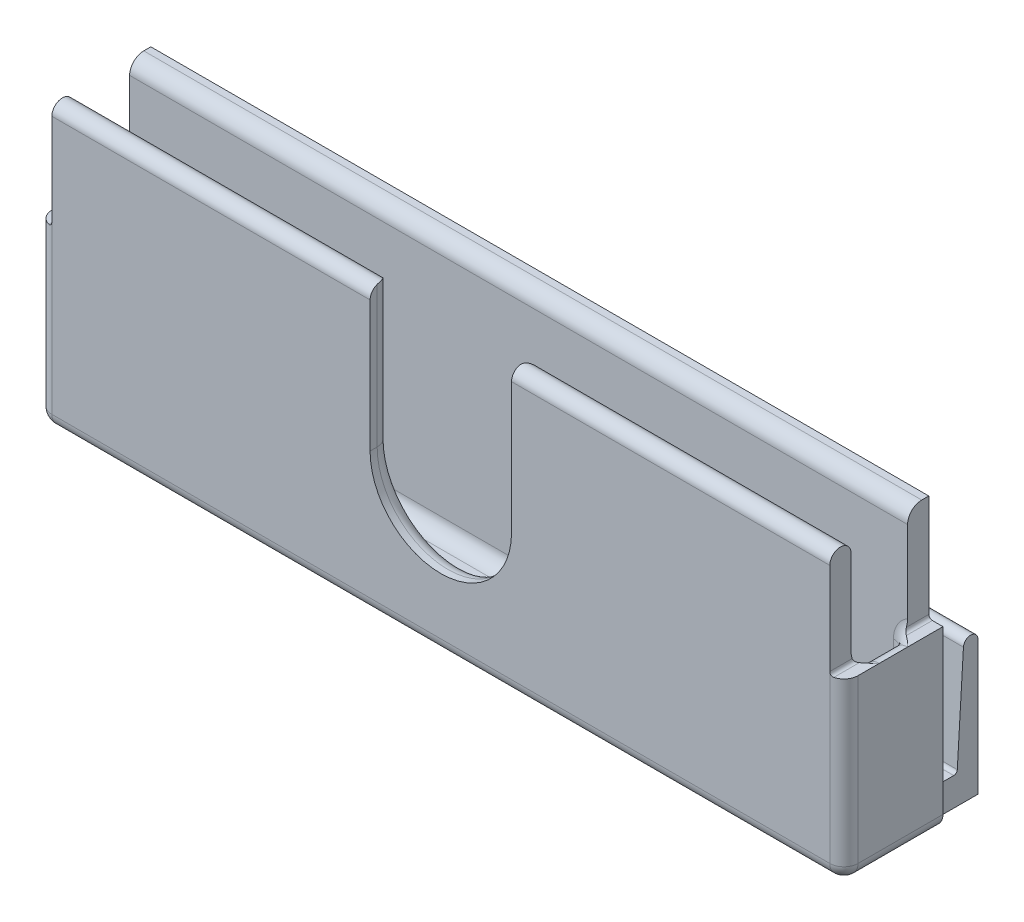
ISO-10303-21;
HEADER;
FILE_DESCRIPTION(('STEP AP214'),'2;1');
FILE_NAME('part.step','',(''),(''),'','','');
FILE_SCHEMA(('AUTOMOTIVE_DESIGN { 1 0 10303 214 1 1 1 1 }'));
ENDSEC;
DATA;
#1=APPLICATION_CONTEXT('core data for automotive mechanical design processes');
#2=APPLICATION_PROTOCOL_DEFINITION('international standard','automotive_design',2000,#1);
#3=PRODUCT_CONTEXT('',#1,'mechanical');
#4=PRODUCT('Part','Part','',(#3));
#5=PRODUCT_RELATED_PRODUCT_CATEGORY('part','',(#4));
#6=PRODUCT_DEFINITION_FORMATION('','',#4);
#7=PRODUCT_DEFINITION_CONTEXT('part definition',#1,'design');
#8=PRODUCT_DEFINITION('design','',#6,#7);
#9=PRODUCT_DEFINITION_SHAPE('','',#8);
#10=(LENGTH_UNIT() NAMED_UNIT(*) SI_UNIT(.MILLI.,.METRE.));
#11=(NAMED_UNIT(*) PLANE_ANGLE_UNIT() SI_UNIT($,.RADIAN.));
#12=(NAMED_UNIT(*) SI_UNIT($,.STERADIAN.) SOLID_ANGLE_UNIT());
#13=UNCERTAINTY_MEASURE_WITH_UNIT(LENGTH_MEASURE(1.E-05),#10,'distance_accuracy_value','');
#14=(GEOMETRIC_REPRESENTATION_CONTEXT(3) GLOBAL_UNCERTAINTY_ASSIGNED_CONTEXT((#13)) GLOBAL_UNIT_ASSIGNED_CONTEXT((#10,
#11,#12)) REPRESENTATION_CONTEXT('',''));
#15=CARTESIAN_POINT('',(0.,0.,0.));
#16=DIRECTION('',(0.,0.,1.));
#17=DIRECTION('',(1.,0.,0.));
#18=AXIS2_PLACEMENT_3D('',#15,#16,#17);
#19=CARTESIAN_POINT('',(0.,24.0920550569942,-25.3073781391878));
#20=DIRECTION('',(-1.,0.,0.));
#21=DIRECTION('',(0.,0.,1.));
#22=AXIS2_PLACEMENT_3D('',#19,#20,#21);
#23=CYLINDRICAL_SURFACE('',#22,1.30794494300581);
#24=DIRECTION('',(-1.,0.,0.));
#25=VECTOR('',#24,1.);
#26=CARTESIAN_POINT('',(139.7,24.0920550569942,-26.6153230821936));
#27=LINE('',#26,#25);
#28=CARTESIAN_POINT('',(0.,24.0920550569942,-26.6153230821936));
#29=VERTEX_POINT('',#28);
#30=CARTESIAN_POINT('',(139.7,24.0920550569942,-26.6153230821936));
#31=VERTEX_POINT('',#30);
#32=EDGE_CURVE('E1255',#29,#31,#27,.F.);
#33=ORIENTED_EDGE('',*,*,#32,.F.);
#34=CARTESIAN_POINT('',(0.,24.0920550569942,-25.3073781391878));
#35=DIRECTION('',(-1.,0.,0.));
#36=DIRECTION('',(0.,0.,1.));
#37=AXIS2_PLACEMENT_3D('',#34,#35,#36);
#38=CIRCLE('',#37,1.30794494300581);
#39=CARTESIAN_POINT('',(0.,24.1701426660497,-24.0017662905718));
#40=VERTEX_POINT('',#39);
#41=EDGE_CURVE('E53',#40,#29,#38,.T.);
#42=ORIENTED_EDGE('',*,*,#41,.F.);
#43=DIRECTION('',(-1.,0.,0.));
#44=VECTOR('',#43,1.);
#45=CARTESIAN_POINT('',(139.7,24.1701426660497,-24.0017662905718));
#46=LINE('',#45,#44);
#47=CARTESIAN_POINT('',(139.7,24.1701426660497,-24.0017662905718));
#48=VERTEX_POINT('',#47);
#49=EDGE_CURVE('E1253',#48,#40,#46,.T.);
#50=ORIENTED_EDGE('',*,*,#49,.F.);
#51=CARTESIAN_POINT('',(139.7,24.0920550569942,-25.3073781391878));
#52=DIRECTION('',(-1.,0.,0.));
#53=DIRECTION('',(0.,0.,1.));
#54=AXIS2_PLACEMENT_3D('',#51,#52,#53);
#55=CIRCLE('',#54,1.30794494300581);
#56=EDGE_CURVE('E12',#31,#48,#55,.F.);
#57=ORIENTED_EDGE('',*,*,#56,.F.);
#58=EDGE_LOOP('',(#33,#42,#50,#57));
#59=FACE_BOUND('',#58,.T.);
#60=ADVANCED_FACE('F44',(#59),#23,.T.);
#61=CARTESIAN_POINT('',(-0.635,32.385,0.));
#62=DIRECTION('',(0.,0.,1.));
#63=DIRECTION('',(1.,0.,0.));
#64=AXIS2_PLACEMENT_3D('',#61,#62,#63);
#65=CYLINDRICAL_SURFACE('',#64,0.635);
#66=DIRECTION('',(0.,0.,1.));
#67=VECTOR('',#66,1.);
#68=CARTESIAN_POINT('',(0.,32.385,0.));
#69=LINE('',#68,#67);
#70=CARTESIAN_POINT('',(0.,32.3850000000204,-4.02118671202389));
#71=VERTEX_POINT('',#70);
#72=CARTESIAN_POINT('',(0.,32.385,0.));
#73=VERTEX_POINT('',#72);
#74=EDGE_CURVE('E853',#71,#73,#69,.T.);
#75=ORIENTED_EDGE('',*,*,#74,.F.);
#76=CARTESIAN_POINT('',(-0.635,31.75,-4.66994791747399));
#77=CARTESIAN_POINT('',(-0.612703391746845,31.7500150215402,-4.65475276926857));
#78=CARTESIAN_POINT('',(-0.590810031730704,31.7511744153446,-4.63901386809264));
#79=CARTESIAN_POINT('',(-0.547813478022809,31.7556390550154,-4.60681574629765));
#80=CARTESIAN_POINT('',(-0.526709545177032,31.7589422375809,-4.59035723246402));
#81=CARTESIAN_POINT('',(-0.485168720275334,31.7675654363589,-4.5570050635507));
#82=CARTESIAN_POINT('',(-0.464734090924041,31.7728916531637,-4.54011022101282));
#83=CARTESIAN_POINT('',(-0.424603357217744,31.7854994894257,-4.50617098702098));
#84=CARTESIAN_POINT('',(-0.40490748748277,31.7927817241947,-4.48912655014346));
#85=CARTESIAN_POINT('',(-0.346757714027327,31.8176141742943,-4.43788167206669));
#86=CARTESIAN_POINT('',(-0.30945282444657,31.8381058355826,-4.40374305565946));
#87=CARTESIAN_POINT('',(-0.23881683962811,31.8869035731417,-4.33703387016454));
#88=CARTESIAN_POINT('',(-0.205480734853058,31.9151996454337,-4.30446135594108));
#89=CARTESIAN_POINT('',(-0.149599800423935,31.9739582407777,-4.24742482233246));
#90=CARTESIAN_POINT('',(-0.126187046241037,32.0031802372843,-4.2225379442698));
#91=CARTESIAN_POINT('',(-0.084244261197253,32.0666667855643,-4.17515611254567));
#92=CARTESIAN_POINT('',(-0.0657108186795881,32.1009277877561,-4.15265949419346));
#93=CARTESIAN_POINT('',(-0.0368552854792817,32.1690484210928,-4.11329443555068));
#94=CARTESIAN_POINT('',(-0.0257808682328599,32.2023860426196,-4.0960744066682));
#95=CARTESIAN_POINT('',(-0.00922514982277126,32.2714891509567,-4.06410002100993));
#96=CARTESIAN_POINT('',(-0.00372997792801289,32.3072483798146,-4.04933962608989));
#97=CARTESIAN_POINT('',(-0.000451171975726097,32.3573500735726,-4.03078720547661));
#98=CARTESIAN_POINT('',(4.27509378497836E-06,32.37114630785,-4.02589392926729));
#99=CARTESIAN_POINT('',(0.,32.3850000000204,-4.02118671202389));
#100=B_SPLINE_CURVE_WITH_KNOTS('',3,(#76,#77,#78,#79,#80,#81,#82,#83,#84,#85,#86,#87,#88,#89,
#90,#91,#92,#93,#94,#95,#96,#97,#98,#99),.UNSPECIFIED.,.F.,.F.,(4,2,2,2,2,2,2,2,2,2,2,4),(0.,
0.0808749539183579,0.161672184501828,0.242719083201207,0.323791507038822,0.486758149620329,
0.649516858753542,0.783862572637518,0.918114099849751,1.03498922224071,1.15157306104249,
1.19547642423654),.UNSPECIFIED.);
#101=CARTESIAN_POINT('',(-0.635,31.75,-4.66994791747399));
#102=VERTEX_POINT('',#101);
#103=EDGE_CURVE('E860',#71,#102,#100,.F.);
#104=ORIENTED_EDGE('',*,*,#103,.T.);
#105=DIRECTION('',(0.,0.,1.));
#106=VECTOR('',#105,1.);
#107=CARTESIAN_POINT('',(-0.635,31.75,0.));
#108=LINE('',#107,#106);
#109=CARTESIAN_POINT('',(-0.635,31.75,-0.0806555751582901));
#110=VERTEX_POINT('',#109);
#111=EDGE_CURVE('E857',#110,#102,#108,.F.);
#112=ORIENTED_EDGE('',*,*,#111,.F.);
#113=CARTESIAN_POINT('',(-0.635,31.75,-0.0806555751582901));
#114=CARTESIAN_POINT('',(-0.600524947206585,31.7499634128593,-0.0717247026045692));
#115=CARTESIAN_POINT('',(-0.565835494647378,31.7528066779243,-0.0635700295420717));
#116=CARTESIAN_POINT('',(-0.497069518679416,31.7641922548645,-0.0488719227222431));
#117=CARTESIAN_POINT('',(-0.462992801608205,31.7727327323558,-0.0423279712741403));
#118=CARTESIAN_POINT('',(-0.396422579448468,31.7954684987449,-0.0308960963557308));
#119=CARTESIAN_POINT('',(-0.3639314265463,31.8096719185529,-0.0260105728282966));
#120=CARTESIAN_POINT('',(-0.301636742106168,31.8433848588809,-0.0177786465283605));
#121=CARTESIAN_POINT('',(-0.271831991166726,31.8628919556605,-0.0144315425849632));
#122=CARTESIAN_POINT('',(-0.216282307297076,31.9063308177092,-0.0090731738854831));
#123=CARTESIAN_POINT('',(-0.190480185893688,31.9301870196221,-0.00704144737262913));
#124=CARTESIAN_POINT('',(-0.14313284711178,31.9818622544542,-0.00392488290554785));
#125=CARTESIAN_POINT('',(-0.121588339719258,32.0096819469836,-0.0028402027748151));
#126=CARTESIAN_POINT('',(-0.0832557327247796,32.0686946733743,-0.0012915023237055));
#127=CARTESIAN_POINT('',(-0.0664990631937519,32.0999082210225,-0.000831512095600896));
#128=CARTESIAN_POINT('',(-0.0383966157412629,32.1646890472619,-0.000251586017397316));
#129=CARTESIAN_POINT('',(-0.027051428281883,32.1982565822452,-0.000131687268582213));
#130=CARTESIAN_POINT('',(-0.010024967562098,32.2671134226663,-3.59941592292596E-06));
#131=CARTESIAN_POINT('',(-0.0043945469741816,32.3024153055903,3.59480251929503E-06));
#132=CARTESIAN_POINT('',(0.000904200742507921,32.3734926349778,-4.79898920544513E-06));
#133=CARTESIAN_POINT('',(0.000567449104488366,32.4092684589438,-2.04063958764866E-05));
#134=CARTESIAN_POINT('',(-0.00281868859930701,32.4447644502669,-1.56397792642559E-06));
#135=B_SPLINE_CURVE_WITH_KNOTS('',3,(#113,#114,#115,#116,#117,#118,#119,#120,#121,#122,#123,
#124,#125,#126,#127,#128,#129,#130,#131,#132,#133,#134),.UNSPECIFIED.,.F.,.F.,(4,2,2,2,2,2,2,2,
2,2,4),(0.,0.106736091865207,0.213437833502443,0.32029333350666,0.427100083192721,
0.532202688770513,0.637322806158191,0.743117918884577,0.848924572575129,0.955664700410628,
1.06249568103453),.UNSPECIFIED.);
#136=EDGE_CURVE('E867',#110,#73,#135,.T.);
#137=ORIENTED_EDGE('',*,*,#136,.T.);
#138=EDGE_LOOP('',(#75,#104,#112,#137));
#139=FACE_BOUND('',#138,.T.);
#140=ADVANCED_FACE('F874',(#139),#65,.F.);
#141=CARTESIAN_POINT('',(-0.635,32.385,0.));
#142=DIRECTION('',(0.,0.,1.));
#143=DIRECTION('',(1.,0.,0.));
#144=AXIS2_PLACEMENT_3D('',#141,#142,#143);
#145=CYLINDRICAL_SURFACE('',#144,0.635);
#146=DIRECTION('',(0.,0.,1.));
#147=VECTOR('',#146,1.);
#148=CARTESIAN_POINT('',(0.,32.385,0.));
#149=LINE('',#148,#147);
#150=CARTESIAN_POINT('',(0.,32.385,-17.78));
#151=VERTEX_POINT('',#150);
#152=CARTESIAN_POINT('',(0.,32.3850000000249,-13.7588132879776));
#153=VERTEX_POINT('',#152);
#154=EDGE_CURVE('E835',#151,#153,#149,.T.);
#155=ORIENTED_EDGE('',*,*,#154,.F.);
#156=CARTESIAN_POINT('',(-0.635,32.385,-17.78));
#157=DIRECTION('',(0.,0.,1.));
#158=DIRECTION('',(0.,-1.,0.));
#159=AXIS2_PLACEMENT_3D('',#156,#157,#158);
#160=CIRCLE('',#159,0.635);
#161=CARTESIAN_POINT('',(-0.635,31.75,-17.78));
#162=VERTEX_POINT('',#161);
#163=EDGE_CURVE('E843',#151,#162,#160,.F.);
#164=ORIENTED_EDGE('',*,*,#163,.T.);
#165=DIRECTION('',(0.,0.,1.));
#166=VECTOR('',#165,1.);
#167=CARTESIAN_POINT('',(-0.635,31.75,0.));
#168=LINE('',#167,#166);
#169=CARTESIAN_POINT('',(-0.635,31.75,-13.110052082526));
#170=VERTEX_POINT('',#169);
#171=EDGE_CURVE('E839',#170,#162,#168,.F.);
#172=ORIENTED_EDGE('',*,*,#171,.F.);
#173=CARTESIAN_POINT('',(0.,32.3850000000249,-13.7588132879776));
#174=CARTESIAN_POINT('',(4.02225238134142E-05,32.3474278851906,-13.7460816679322));
#175=CARTESIAN_POINT('',(-0.003327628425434,32.3104132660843,-13.7319815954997));
#176=CARTESIAN_POINT('',(-0.0160238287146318,32.2387283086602,-13.7013192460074));
#177=CARTESIAN_POINT('',(-0.0253179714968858,32.2040457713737,-13.6847715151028));
#178=CARTESIAN_POINT('',(-0.0490034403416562,32.1378739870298,-13.649377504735));
#179=CARTESIAN_POINT('',(-0.0633835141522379,32.1063778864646,-13.6305363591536));
#180=CARTESIAN_POINT('',(-0.09633266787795,32.0470429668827,-13.5908288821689));
#181=CARTESIAN_POINT('',(-0.114906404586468,32.0192082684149,-13.5699603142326));
#182=CARTESIAN_POINT('',(-0.157692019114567,31.964595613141,-13.5241073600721));
#183=CARTESIAN_POINT('',(-0.182305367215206,31.9383004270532,-13.4989250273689));
#184=CARTESIAN_POINT('',(-0.234703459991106,31.8907925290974,-13.4470724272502));
#185=CARTESIAN_POINT('',(-0.262492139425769,31.8695862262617,-13.4204003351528));
#186=CARTESIAN_POINT('',(-0.325956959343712,31.8287651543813,-13.3611144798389));
#187=CARTESIAN_POINT('',(-0.362135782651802,31.8101915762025,-13.3283231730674));
#188=CARTESIAN_POINT('',(-0.437255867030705,31.780220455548,-13.2627206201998));
#189=CARTESIAN_POINT('',(-0.476192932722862,31.7688122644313,-13.2299094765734));
#190=CARTESIAN_POINT('',(-0.535592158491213,31.757527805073,-13.1827139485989));
#191=CARTESIAN_POINT('',(-0.555024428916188,31.7547416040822,-13.1676970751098));
#192=CARTESIAN_POINT('',(-0.594522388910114,31.7509834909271,-13.1383181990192));
#193=CARTESIAN_POINT('',(-0.614587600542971,31.7500102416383,-13.1239557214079));
#194=CARTESIAN_POINT('',(-0.634999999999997,31.75,-13.110052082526));
#195=B_SPLINE_CURVE_WITH_KNOTS('',3,(#173,#174,#175,#176,#177,#178,#179,#180,#181,#182,#183,
#184,#185,#186,#187,#188,#189,#190,#191,#192,#193,#194),.UNSPECIFIED.,.F.,.F.,(4,2,2,2,2,2,2,2,
2,2,4),(0.,0.11871275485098,0.236746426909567,0.354520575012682,0.47242615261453,
0.603781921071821,0.735302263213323,0.89144466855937,1.04735447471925,1.12143121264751,
1.19545329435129),.UNSPECIFIED.);
#196=EDGE_CURVE('E846',#170,#153,#195,.F.);
#197=ORIENTED_EDGE('',*,*,#196,.T.);
#198=EDGE_LOOP('',(#155,#164,#172,#197));
#199=FACE_BOUND('',#198,.T.);
#200=ADVANCED_FACE('F820',(#199),#145,.F.);
#201=CARTESIAN_POINT('',(140.335,32.385,0.));
#202=DIRECTION('',(0.,0.,1.));
#203=DIRECTION('',(1.,0.,0.));
#204=AXIS2_PLACEMENT_3D('',#201,#202,#203);
#205=CYLINDRICAL_SURFACE('',#204,0.635);
#206=DIRECTION('',(0.,0.,-1.));
#207=VECTOR('',#206,1.);
#208=CARTESIAN_POINT('',(139.7,32.385,0.));
#209=LINE('',#208,#207);
#210=CARTESIAN_POINT('',(139.7,32.3850000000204,-13.7588132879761));
#211=VERTEX_POINT('',#210);
#212=CARTESIAN_POINT('',(139.7,32.385,-17.78));
#213=VERTEX_POINT('',#212);
#214=EDGE_CURVE('E797',#211,#213,#209,.T.);
#215=ORIENTED_EDGE('',*,*,#214,.F.);
#216=CARTESIAN_POINT('',(140.335,31.75,-13.110052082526));
#217=CARTESIAN_POINT('',(140.312703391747,31.7500150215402,-13.1252472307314));
#218=CARTESIAN_POINT('',(140.290810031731,31.7511744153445,-13.1409861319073));
#219=CARTESIAN_POINT('',(140.247813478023,31.7556390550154,-13.1731842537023));
#220=CARTESIAN_POINT('',(140.226709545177,31.7589422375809,-13.189642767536));
#221=CARTESIAN_POINT('',(140.185168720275,31.7675654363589,-13.2229949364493));
#222=CARTESIAN_POINT('',(140.164734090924,31.7728916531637,-13.2398897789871));
#223=CARTESIAN_POINT('',(140.124603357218,31.7854994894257,-13.273829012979));
#224=CARTESIAN_POINT('',(140.104907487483,31.7927817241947,-13.2908734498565));
#225=CARTESIAN_POINT('',(140.046757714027,31.8176141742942,-13.3421183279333));
#226=CARTESIAN_POINT('',(140.009452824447,31.8381058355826,-13.3762569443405));
#227=CARTESIAN_POINT('',(139.938816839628,31.8869035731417,-13.4429661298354));
#228=CARTESIAN_POINT('',(139.905480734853,31.9151996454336,-13.4755386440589));
#229=CARTESIAN_POINT('',(139.849599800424,31.9739582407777,-13.5325751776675));
#230=CARTESIAN_POINT('',(139.826187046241,32.0031802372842,-13.5574620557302));
#231=CARTESIAN_POINT('',(139.784244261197,32.0666667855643,-13.6048438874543));
#232=CARTESIAN_POINT('',(139.76571081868,32.1009277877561,-13.6273405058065));
#233=CARTESIAN_POINT('',(139.736855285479,32.1690484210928,-13.6667055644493));
#234=CARTESIAN_POINT('',(139.725780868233,32.2023860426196,-13.6839255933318));
#235=CARTESIAN_POINT('',(139.709225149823,32.2714891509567,-13.7158999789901));
#236=CARTESIAN_POINT('',(139.703729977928,32.3072483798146,-13.7306603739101));
#237=CARTESIAN_POINT('',(139.700451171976,32.3573500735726,-13.7492127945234));
#238=CARTESIAN_POINT('',(139.699995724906,32.37114630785,-13.7541060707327));
#239=CARTESIAN_POINT('',(139.7,32.3850000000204,-13.7588132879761));
#240=B_SPLINE_CURVE_WITH_KNOTS('',3,(#216,#217,#218,#219,#220,#221,#222,#223,#224,#225,#226,
#227,#228,#229,#230,#231,#232,#233,#234,#235,#236,#237,#238,#239),.UNSPECIFIED.,.F.,.F.,(4,2,2,
2,2,2,2,2,2,2,2,4),(0.,0.0808749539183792,0.161672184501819,0.24271908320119,0.32379150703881,
0.486758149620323,0.649516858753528,0.783862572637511,0.918114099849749,1.03498922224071,
1.15157306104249,1.19547642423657),.UNSPECIFIED.);
#241=CARTESIAN_POINT('',(140.335,31.75,-13.110052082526));
#242=VERTEX_POINT('',#241);
#243=EDGE_CURVE('E824',#211,#242,#240,.F.);
#244=ORIENTED_EDGE('',*,*,#243,.T.);
#245=DIRECTION('',(0.,0.,-1.));
#246=VECTOR('',#245,1.);
#247=CARTESIAN_POINT('',(140.335,31.75,0.));
#248=LINE('',#247,#246);
#249=CARTESIAN_POINT('',(140.335,31.75,-17.78));
#250=VERTEX_POINT('',#249);
#251=EDGE_CURVE('E832',#250,#242,#248,.F.);
#252=ORIENTED_EDGE('',*,*,#251,.F.);
#253=CARTESIAN_POINT('',(140.335,32.385,-17.78));
#254=DIRECTION('',(0.,0.,1.));
#255=DIRECTION('',(0.,-1.,0.));
#256=AXIS2_PLACEMENT_3D('',#253,#254,#255);
#257=CIRCLE('',#256,0.635);
#258=EDGE_CURVE('E831',#250,#213,#257,.F.);
#259=ORIENTED_EDGE('',*,*,#258,.T.);
#260=EDGE_LOOP('',(#215,#244,#252,#259));
#261=FACE_BOUND('',#260,.T.);
#262=ADVANCED_FACE('F812',(#261),#205,.F.);
#263=CARTESIAN_POINT('',(140.335,32.385,0.));
#264=DIRECTION('',(0.,0.,1.));
#265=DIRECTION('',(1.,0.,0.));
#266=AXIS2_PLACEMENT_3D('',#263,#264,#265);
#267=CYLINDRICAL_SURFACE('',#266,0.635);
#268=DIRECTION('',(0.,0.,-1.));
#269=VECTOR('',#268,1.);
#270=CARTESIAN_POINT('',(139.7,32.385,0.));
#271=LINE('',#270,#269);
#272=CARTESIAN_POINT('',(139.7,32.385,0.));
#273=VERTEX_POINT('',#272);
#274=CARTESIAN_POINT('',(139.7,32.3850000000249,-4.02118671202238));
#275=VERTEX_POINT('',#274);
#276=EDGE_CURVE('E1078',#273,#275,#271,.T.);
#277=ORIENTED_EDGE('',*,*,#276,.F.);
#278=CARTESIAN_POINT('',(140.335,31.75,-0.0806555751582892));
#279=CARTESIAN_POINT('',(140.300524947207,31.7499634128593,-0.0717247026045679));
#280=CARTESIAN_POINT('',(140.265835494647,31.7528066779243,-0.0635700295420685));
#281=CARTESIAN_POINT('',(140.197069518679,31.7641922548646,-0.0488719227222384));
#282=CARTESIAN_POINT('',(140.162992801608,31.7727327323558,-0.0423279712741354));
#283=CARTESIAN_POINT('',(140.096422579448,31.7954684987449,-0.0308960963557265));
#284=CARTESIAN_POINT('',(140.063931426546,31.8096719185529,-0.0260105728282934));
#285=CARTESIAN_POINT('',(140.001636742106,31.843384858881,-0.0177786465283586));
#286=CARTESIAN_POINT('',(139.971831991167,31.8628919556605,-0.0144315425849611));
#287=CARTESIAN_POINT('',(139.916282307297,31.9063308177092,-0.00907317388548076));
#288=CARTESIAN_POINT('',(139.890480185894,31.9301870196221,-0.00704144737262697));
#289=CARTESIAN_POINT('',(139.843132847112,31.9818622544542,-0.00392488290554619));
#290=CARTESIAN_POINT('',(139.821588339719,32.0096819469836,-0.00284020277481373));
#291=CARTESIAN_POINT('',(139.783255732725,32.0686946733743,-0.00129150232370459));
#292=CARTESIAN_POINT('',(139.766499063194,32.0999082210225,-0.000831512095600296));
#293=CARTESIAN_POINT('',(139.738396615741,32.164689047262,-0.000251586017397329));
#294=CARTESIAN_POINT('',(139.727051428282,32.1982565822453,-0.000131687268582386));
#295=CARTESIAN_POINT('',(139.710024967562,32.2671134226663,-3.59941592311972E-06));
#296=CARTESIAN_POINT('',(139.704394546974,32.3024153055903,3.59480251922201E-06));
#297=CARTESIAN_POINT('',(139.699095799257,32.3734926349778,-4.79898920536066E-06));
#298=CARTESIAN_POINT('',(139.699432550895,32.4092684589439,-2.04063958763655E-05));
#299=CARTESIAN_POINT('',(139.702818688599,32.4447644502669,-1.56397792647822E-06));
#300=B_SPLINE_CURVE_WITH_KNOTS('',3,(#278,#279,#280,#281,#282,#283,#284,#285,#286,#287,#288,
#289,#290,#291,#292,#293,#294,#295,#296,#297,#298,#299),.UNSPECIFIED.,.F.,.F.,(4,2,2,2,2,2,2,2,
2,2,4),(0.,0.106736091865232,0.213437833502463,0.320293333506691,0.427100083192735,
0.532202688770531,0.637322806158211,0.743117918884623,0.848924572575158,0.955664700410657,
1.06249568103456),.UNSPECIFIED.);
#301=CARTESIAN_POINT('',(140.335,31.75,-0.0806555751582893));
#302=VERTEX_POINT('',#301);
#303=EDGE_CURVE('E798',#273,#302,#300,.F.);
#304=ORIENTED_EDGE('',*,*,#303,.T.);
#305=DIRECTION('',(0.,0.,-1.));
#306=VECTOR('',#305,1.);
#307=CARTESIAN_POINT('',(140.335,31.75,0.));
#308=LINE('',#307,#306);
#309=CARTESIAN_POINT('',(140.335,31.75,-4.66994791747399));
#310=VERTEX_POINT('',#309);
#311=EDGE_CURVE('E1077',#310,#302,#308,.F.);
#312=ORIENTED_EDGE('',*,*,#311,.F.);
#313=CARTESIAN_POINT('',(139.7,32.3850000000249,-4.02118671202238));
#314=CARTESIAN_POINT('',(139.699959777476,32.3474278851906,-4.03391833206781));
#315=CARTESIAN_POINT('',(139.703327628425,32.3104132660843,-4.04801840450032));
#316=CARTESIAN_POINT('',(139.716023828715,32.2387283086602,-4.07868075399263));
#317=CARTESIAN_POINT('',(139.725317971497,32.2040457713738,-4.09522848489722));
#318=CARTESIAN_POINT('',(139.749003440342,32.1378739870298,-4.13062249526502));
#319=CARTESIAN_POINT('',(139.763383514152,32.1063778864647,-4.14946364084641));
#320=CARTESIAN_POINT('',(139.796332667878,32.0470429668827,-4.18917111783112));
#321=CARTESIAN_POINT('',(139.814906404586,32.0192082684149,-4.21003968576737));
#322=CARTESIAN_POINT('',(139.857692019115,31.964595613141,-4.25589263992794));
#323=CARTESIAN_POINT('',(139.882305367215,31.9383004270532,-4.28107497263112));
#324=CARTESIAN_POINT('',(139.934703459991,31.8907925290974,-4.33292757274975));
#325=CARTESIAN_POINT('',(139.962492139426,31.8695862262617,-4.35959966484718));
#326=CARTESIAN_POINT('',(140.025956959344,31.8287651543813,-4.41888552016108));
#327=CARTESIAN_POINT('',(140.062135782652,31.8101915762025,-4.45167682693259));
#328=CARTESIAN_POINT('',(140.137255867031,31.780220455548,-4.51727937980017));
#329=CARTESIAN_POINT('',(140.176192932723,31.7688122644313,-4.5500905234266));
#330=CARTESIAN_POINT('',(140.235592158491,31.757527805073,-4.59728605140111));
#331=CARTESIAN_POINT('',(140.255024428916,31.7547416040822,-4.61230292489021));
#332=CARTESIAN_POINT('',(140.29452238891,31.7509834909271,-4.64168180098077));
#333=CARTESIAN_POINT('',(140.314587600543,31.7500102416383,-4.6560442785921));
#334=CARTESIAN_POINT('',(140.335,31.75,-4.669947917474));
#335=B_SPLINE_CURVE_WITH_KNOTS('',3,(#313,#314,#315,#316,#317,#318,#319,#320,#321,#322,#323,
#324,#325,#326,#327,#328,#329,#330,#331,#332,#333,#334),.UNSPECIFIED.,.F.,.F.,(4,2,2,2,2,2,2,2,
2,2,4),(0.,0.118712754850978,0.236746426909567,0.354520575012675,0.472426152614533,
0.603781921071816,0.735302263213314,0.891444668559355,1.04735447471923,1.12143121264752,
1.19545329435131),.UNSPECIFIED.);
#336=EDGE_CURVE('E788',#310,#275,#335,.F.);
#337=ORIENTED_EDGE('',*,*,#336,.T.);
#338=EDGE_LOOP('',(#277,#304,#312,#337));
#339=FACE_BOUND('',#338,.T.);
#340=ADVANCED_FACE('F806',(#339),#267,.F.);
#341=CARTESIAN_POINT('',(140.335,0.,-18.415));
#342=DIRECTION('',(0.,1.,0.));
#343=DIRECTION('',(0.,0.,1.));
#344=AXIS2_PLACEMENT_3D('',#341,#342,#343);
#345=CYLINDRICAL_SURFACE('',#344,0.635);
#346=DIRECTION('',(0.,-1.,0.));
#347=VECTOR('',#346,1.);
#348=CARTESIAN_POINT('',(139.7,0.,-18.415));
#349=LINE('',#348,#347);
#350=CARTESIAN_POINT('',(139.7,5.08,-18.415));
#351=VERTEX_POINT('',#350);
#352=CARTESIAN_POINT('',(139.7,0.,-18.415));
#353=VERTEX_POINT('',#352);
#354=EDGE_CURVE('E1244',#351,#353,#349,.T.);
#355=ORIENTED_EDGE('',*,*,#354,.F.);
#356=CARTESIAN_POINT('',(140.335,5.715,-18.415));
#357=DIRECTION('',(-0.707106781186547,0.707106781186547,0.));
#358=DIRECTION('',(-0.707106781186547,-0.707106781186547,0.));
#359=AXIS2_PLACEMENT_3D('',#356,#357,#358);
#360=ELLIPSE('',#359,0.898025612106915,0.635);
#361=CARTESIAN_POINT('',(140.335,5.715,-17.78));
#362=VERTEX_POINT('',#361);
#363=EDGE_CURVE('E1084',#351,#362,#360,.T.);
#364=ORIENTED_EDGE('',*,*,#363,.T.);
#365=DIRECTION('',(0.,-1.,0.));
#366=VECTOR('',#365,1.);
#367=CARTESIAN_POINT('',(140.335,0.,-17.78));
#368=LINE('',#367,#366);
#369=CARTESIAN_POINT('',(140.335,0.0806555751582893,-17.78));
#370=VERTEX_POINT('',#369);
#371=EDGE_CURVE('E1286',#370,#362,#368,.F.);
#372=ORIENTED_EDGE('',*,*,#371,.F.);
#373=CARTESIAN_POINT('',(140.335,0.0806555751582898,-17.78));
#374=CARTESIAN_POINT('',(140.300524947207,0.0717247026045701,-17.7799634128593));
#375=CARTESIAN_POINT('',(140.265835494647,0.0635700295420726,-17.7828066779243));
#376=CARTESIAN_POINT('',(140.197069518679,0.0488719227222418,-17.7941922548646));
#377=CARTESIAN_POINT('',(140.162992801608,0.0423279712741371,-17.8027327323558));
#378=CARTESIAN_POINT('',(140.096422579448,0.0308960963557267,-17.8254684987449));
#379=CARTESIAN_POINT('',(140.063931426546,0.0260105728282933,-17.8396719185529));
#380=CARTESIAN_POINT('',(140.001636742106,0.0177786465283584,-17.873384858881));
#381=CARTESIAN_POINT('',(139.971831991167,0.0144315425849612,-17.8928919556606));
#382=CARTESIAN_POINT('',(139.916282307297,0.0090731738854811,-17.9363308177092));
#383=CARTESIAN_POINT('',(139.890480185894,0.00704144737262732,-17.9601870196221));
#384=CARTESIAN_POINT('',(139.843132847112,0.00392488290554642,-18.0118622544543));
#385=CARTESIAN_POINT('',(139.821588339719,0.00284020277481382,-18.0396819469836));
#386=CARTESIAN_POINT('',(139.783255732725,0.00129150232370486,-18.0986946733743));
#387=CARTESIAN_POINT('',(139.766499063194,0.000831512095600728,-18.1299082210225));
#388=CARTESIAN_POINT('',(139.738396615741,0.000251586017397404,-18.194689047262));
#389=CARTESIAN_POINT('',(139.727051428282,0.000131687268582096,-18.2282565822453));
#390=CARTESIAN_POINT('',(139.710024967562,3.59941592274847E-06,-18.2971134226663));
#391=CARTESIAN_POINT('',(139.704394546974,-3.59480251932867E-06,-18.3324153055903));
#392=CARTESIAN_POINT('',(139.699095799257,4.79898920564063E-06,-18.4034926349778));
#393=CARTESIAN_POINT('',(139.699432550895,2.04063958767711E-05,-18.4392684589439));
#394=CARTESIAN_POINT('',(139.702818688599,1.5639779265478E-06,-18.4747644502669));
#395=B_SPLINE_CURVE_WITH_KNOTS('',3,(#373,#374,#375,#376,#377,#378,#379,#380,#381,#382,#383,
#384,#385,#386,#387,#388,#389,#390,#391,#392,#393,#394),.UNSPECIFIED.,.F.,.F.,(4,2,2,2,2,2,2,2,
2,2,4),(0.,0.106736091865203,0.213437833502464,0.32029333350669,0.427100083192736,
0.532202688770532,0.637322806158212,0.743117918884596,0.848924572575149,0.955664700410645,
1.06249568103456),.UNSPECIFIED.);
#396=EDGE_CURVE('E1080',#370,#353,#395,.T.);
#397=ORIENTED_EDGE('',*,*,#396,.T.);
#398=EDGE_LOOP('',(#355,#364,#372,#397));
#399=FACE_BOUND('',#398,.T.);
#400=ADVANCED_FACE('F811',(#399),#345,.F.);
#401=CARTESIAN_POINT('',(-0.635,0.,-18.415));
#402=DIRECTION('',(0.,1.,0.));
#403=DIRECTION('',(0.,0.,1.));
#404=AXIS2_PLACEMENT_3D('',#401,#402,#403);
#405=CYLINDRICAL_SURFACE('',#404,0.635);
#406=DIRECTION('',(0.,1.,0.));
#407=VECTOR('',#406,1.);
#408=CARTESIAN_POINT('',(0.,0.,-18.415));
#409=LINE('',#408,#407);
#410=CARTESIAN_POINT('',(0.,0.,-18.415));
#411=VERTEX_POINT('',#410);
#412=CARTESIAN_POINT('',(0.,5.08,-18.415));
#413=VERTEX_POINT('',#412);
#414=EDGE_CURVE('E1168',#411,#413,#409,.T.);
#415=ORIENTED_EDGE('',*,*,#414,.F.);
#416=CARTESIAN_POINT('',(-0.635000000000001,0.0806555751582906,-17.78));
#417=CARTESIAN_POINT('',(-0.600524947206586,0.0717247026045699,-17.7799634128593));
#418=CARTESIAN_POINT('',(-0.565835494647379,0.0635700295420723,-17.7828066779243));
#419=CARTESIAN_POINT('',(-0.497069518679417,0.0488719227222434,-17.7941922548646));
#420=CARTESIAN_POINT('',(-0.462992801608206,0.0423279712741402,-17.8027327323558));
#421=CARTESIAN_POINT('',(-0.396422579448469,0.0308960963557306,-17.8254684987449));
#422=CARTESIAN_POINT('',(-0.363931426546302,0.0260105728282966,-17.8396719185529));
#423=CARTESIAN_POINT('',(-0.30163674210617,0.0177786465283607,-17.873384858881));
#424=CARTESIAN_POINT('',(-0.271831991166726,0.0144315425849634,-17.8928919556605));
#425=CARTESIAN_POINT('',(-0.216282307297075,0.00907317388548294,-17.9363308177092));
#426=CARTESIAN_POINT('',(-0.190480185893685,0.00704144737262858,-17.9601870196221));
#427=CARTESIAN_POINT('',(-0.143132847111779,0.00392488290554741,-18.0118622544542));
#428=CARTESIAN_POINT('',(-0.121588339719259,0.00284020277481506,-18.0396819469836));
#429=CARTESIAN_POINT('',(-0.0832557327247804,0.00129150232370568,-18.0986946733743));
#430=CARTESIAN_POINT('',(-0.0664990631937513,0.000831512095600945,-18.1299082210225));
#431=CARTESIAN_POINT('',(-0.0383966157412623,0.000251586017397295,-18.1946890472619));
#432=CARTESIAN_POINT('',(-0.0270514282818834,0.000131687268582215,-18.2282565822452));
#433=CARTESIAN_POINT('',(-0.0100249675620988,3.59941592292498E-06,-18.2971134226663));
#434=CARTESIAN_POINT('',(-0.00439454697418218,-3.59480251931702E-06,-18.3324153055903));
#435=CARTESIAN_POINT('',(0.000904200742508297,4.79898920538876E-06,-18.4034926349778));
#436=CARTESIAN_POINT('',(0.000567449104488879,2.0406395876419E-05,-18.4392684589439));
#437=CARTESIAN_POINT('',(-0.00281868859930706,1.56397792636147E-06,-18.4747644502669));
#438=B_SPLINE_CURVE_WITH_KNOTS('',3,(#416,#417,#418,#419,#420,#421,#422,#423,#424,#425,#426,
#427,#428,#429,#430,#431,#432,#433,#434,#435,#436,#437),.UNSPECIFIED.,.F.,.F.,(4,2,2,2,2,2,2,2,
2,2,4),(0.,0.106736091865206,0.213437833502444,0.320293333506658,0.427100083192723,
0.532202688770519,0.637322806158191,0.743117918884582,0.848924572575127,0.955664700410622,
1.06249568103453),.UNSPECIFIED.);
#439=CARTESIAN_POINT('',(-0.635000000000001,0.0806555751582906,-17.78));
#440=VERTEX_POINT('',#439);
#441=EDGE_CURVE('E1107',#411,#440,#438,.F.);
#442=ORIENTED_EDGE('',*,*,#441,.T.);
#443=DIRECTION('',(0.,1.,0.));
#444=VECTOR('',#443,1.);
#445=CARTESIAN_POINT('',(-0.634999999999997,50.8,-17.78));
#446=LINE('',#445,#444);
#447=CARTESIAN_POINT('',(-0.634999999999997,5.715,-17.78));
#448=VERTEX_POINT('',#447);
#449=EDGE_CURVE('E1117',#448,#440,#446,.F.);
#450=ORIENTED_EDGE('',*,*,#449,.F.);
#451=CARTESIAN_POINT('',(-0.634999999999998,5.715,-18.415));
#452=DIRECTION('',(-0.707106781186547,-0.707106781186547,0.));
#453=DIRECTION('',(-0.707106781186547,0.707106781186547,0.));
#454=AXIS2_PLACEMENT_3D('',#451,#452,#453);
#455=ELLIPSE('',#454,0.898025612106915,0.635);
#456=EDGE_CURVE('E1116',#448,#413,#455,.F.);
#457=ORIENTED_EDGE('',*,*,#456,.T.);
#458=EDGE_LOOP('',(#415,#442,#450,#457));
#459=FACE_BOUND('',#458,.T.);
#460=ADVANCED_FACE('F1102',(#459),#405,.F.);
#461=CARTESIAN_POINT('',(139.7,2.54,-2.54));
#462=DIRECTION('',(0.,1.,0.));
#463=DIRECTION('',(0.,0.,1.));
#464=AXIS2_PLACEMENT_3D('',#461,#462,#463);
#465=SPHERICAL_SURFACE('',#464,2.54);
#466=CARTESIAN_POINT('',(139.7,2.54,-2.54));
#467=DIRECTION('',(0.,0.,-1.));
#468=DIRECTION('',(-1.,0.,0.));
#469=AXIS2_PLACEMENT_3D('',#466,#467,#468);
#470=CIRCLE('',#469,2.54);
#471=CARTESIAN_POINT('',(142.24,2.54,-2.54));
#472=VERTEX_POINT('',#471);
#473=CARTESIAN_POINT('',(139.7,0.,-2.54));
#474=VERTEX_POINT('',#473);
#475=EDGE_CURVE('E1145',#472,#474,#470,.T.);
#476=ORIENTED_EDGE('',*,*,#475,.F.);
#477=CARTESIAN_POINT('',(139.7,2.54,-2.54));
#478=DIRECTION('',(0.,1.,0.));
#479=DIRECTION('',(0.,0.,1.));
#480=AXIS2_PLACEMENT_3D('',#477,#478,#479);
#481=CIRCLE('',#480,2.54);
#482=CARTESIAN_POINT('',(139.7,2.54,0.));
#483=VERTEX_POINT('',#482);
#484=EDGE_CURVE('E1148',#483,#472,#481,.T.);
#485=ORIENTED_EDGE('',*,*,#484,.F.);
#486=CARTESIAN_POINT('',(139.7,2.54,-2.54));
#487=DIRECTION('',(1.,0.,0.));
#488=DIRECTION('',(0.,0.,-1.));
#489=AXIS2_PLACEMENT_3D('',#486,#487,#488);
#490=CIRCLE('',#489,2.54);
#491=EDGE_CURVE('E1138',#483,#474,#490,.T.);
#492=ORIENTED_EDGE('',*,*,#491,.T.);
#493=EDGE_LOOP('',(#476,#485,#492));
#494=FACE_BOUND('',#493,.T.);
#495=ADVANCED_FACE('F1100',(#494),#465,.T.);
#496=CARTESIAN_POINT('',(139.7,2.54,-2.54));
#497=DIRECTION('',(1.,0.,0.));
#498=DIRECTION('',(0.,0.,-1.));
#499=AXIS2_PLACEMENT_3D('',#496,#497,#498);
#500=CYLINDRICAL_SURFACE('',#499,2.54);
#501=ORIENTED_EDGE('',*,*,#491,.F.);
#502=DIRECTION('',(1.,0.,0.));
#503=VECTOR('',#502,1.);
#504=CARTESIAN_POINT('',(139.7,2.54,0.));
#505=LINE('',#504,#503);
#506=CARTESIAN_POINT('',(0.,2.54,0.));
#507=VERTEX_POINT('',#506);
#508=EDGE_CURVE('E1067',#507,#483,#505,.T.);
#509=ORIENTED_EDGE('',*,*,#508,.F.);
#510=CARTESIAN_POINT('',(0.,2.54,-2.54));
#511=DIRECTION('',(1.,0.,0.));
#512=DIRECTION('',(0.,0.,-1.));
#513=AXIS2_PLACEMENT_3D('',#510,#511,#512);
#514=CIRCLE('',#513,2.54);
#515=CARTESIAN_POINT('',(0.,0.,-2.54));
#516=VERTEX_POINT('',#515);
#517=EDGE_CURVE('E1146',#507,#516,#514,.T.);
#518=ORIENTED_EDGE('',*,*,#517,.T.);
#519=DIRECTION('',(1.,0.,0.));
#520=VECTOR('',#519,1.);
#521=CARTESIAN_POINT('',(139.7,0.,-2.54));
#522=LINE('',#521,#520);
#523=EDGE_CURVE('E1143',#474,#516,#522,.F.);
#524=ORIENTED_EDGE('',*,*,#523,.F.);
#525=EDGE_LOOP('',(#501,#509,#518,#524));
#526=FACE_BOUND('',#525,.T.);
#527=ADVANCED_FACE('F1128',(#526),#500,.T.);
#528=CARTESIAN_POINT('',(0.,2.54,-2.54));
#529=DIRECTION('',(0.,1.,0.));
#530=DIRECTION('',(0.,0.,1.));
#531=AXIS2_PLACEMENT_3D('',#528,#529,#530);
#532=SPHERICAL_SURFACE('',#531,2.54);
#533=ORIENTED_EDGE('',*,*,#517,.F.);
#534=CARTESIAN_POINT('',(0.,2.54,-2.54));
#535=DIRECTION('',(0.,1.,0.));
#536=DIRECTION('',(0.,0.,1.));
#537=AXIS2_PLACEMENT_3D('',#534,#535,#536);
#538=CIRCLE('',#537,2.54);
#539=CARTESIAN_POINT('',(-2.54,2.54,-2.54));
#540=VERTEX_POINT('',#539);
#541=EDGE_CURVE('E1158',#540,#507,#538,.T.);
#542=ORIENTED_EDGE('',*,*,#541,.F.);
#543=CARTESIAN_POINT('',(0.,2.54,-2.54));
#544=DIRECTION('',(0.,0.,1.));
#545=DIRECTION('',(1.,0.,0.));
#546=AXIS2_PLACEMENT_3D('',#543,#544,#545);
#547=CIRCLE('',#546,2.54);
#548=EDGE_CURVE('E1156',#540,#516,#547,.T.);
#549=ORIENTED_EDGE('',*,*,#548,.T.);
#550=EDGE_LOOP('',(#533,#542,#549));
#551=FACE_BOUND('',#550,.T.);
#552=ADVANCED_FACE('F1124',(#551),#532,.T.);
#553=CARTESIAN_POINT('',(0.,2.54,0.));
#554=DIRECTION('',(0.,0.,-1.));
#555=DIRECTION('',(-1.,0.,0.));
#556=AXIS2_PLACEMENT_3D('',#553,#554,#555);
#557=CYLINDRICAL_SURFACE('',#556,2.54);
#558=ORIENTED_EDGE('',*,*,#548,.F.);
#559=DIRECTION('',(0.,0.,1.));
#560=VECTOR('',#559,1.);
#561=CARTESIAN_POINT('',(-2.54,2.54,0.));
#562=LINE('',#561,#560);
#563=CARTESIAN_POINT('',(-2.54,2.54,-17.78));
#564=VERTEX_POINT('',#563);
#565=EDGE_CURVE('E718',#564,#540,#562,.T.);
#566=ORIENTED_EDGE('',*,*,#565,.F.);
#567=CARTESIAN_POINT('',(0.,2.54,-17.78));
#568=DIRECTION('',(0.,0.,1.));
#569=DIRECTION('',(0.,-1.,0.));
#570=AXIS2_PLACEMENT_3D('',#567,#568,#569);
#571=CIRCLE('',#570,2.54);
#572=EDGE_CURVE('E1181',#440,#564,#571,.F.);
#573=ORIENTED_EDGE('',*,*,#572,.F.);
#574=ORIENTED_EDGE('',*,*,#441,.F.);
#575=DIRECTION('',(0.,0.,-1.));
#576=VECTOR('',#575,1.);
#577=CARTESIAN_POINT('',(0.,0.,0.));
#578=LINE('',#577,#576);
#579=EDGE_CURVE('E450',#516,#411,#578,.T.);
#580=ORIENTED_EDGE('',*,*,#579,.F.);
#581=EDGE_LOOP('',(#558,#566,#573,#574,#580));
#582=FACE_BOUND('',#581,.T.);
#583=ADVANCED_FACE('F1098',(#582),#557,.T.);
#584=CARTESIAN_POINT('',(139.7,2.54,0.));
#585=DIRECTION('',(0.,0.,-1.));
#586=DIRECTION('',(-1.,0.,0.));
#587=AXIS2_PLACEMENT_3D('',#584,#585,#586);
#588=CYLINDRICAL_SURFACE('',#587,2.54);
#589=DIRECTION('',(0.,0.,-1.));
#590=VECTOR('',#589,1.);
#591=CARTESIAN_POINT('',(142.24,2.54,0.));
#592=LINE('',#591,#590);
#593=CARTESIAN_POINT('',(142.24,2.54,-17.78));
#594=VERTEX_POINT('',#593);
#595=EDGE_CURVE('E1152',#472,#594,#592,.T.);
#596=ORIENTED_EDGE('',*,*,#595,.F.);
#597=ORIENTED_EDGE('',*,*,#475,.T.);
#598=DIRECTION('',(0.,0.,-1.));
#599=VECTOR('',#598,1.);
#600=CARTESIAN_POINT('',(139.7,0.,0.));
#601=LINE('',#600,#599);
#602=EDGE_CURVE('E417',#474,#353,#601,.T.);
#603=ORIENTED_EDGE('',*,*,#602,.T.);
#604=ORIENTED_EDGE('',*,*,#396,.F.);
#605=CARTESIAN_POINT('',(139.7,2.54,-17.78));
#606=DIRECTION('',(0.,0.,1.));
#607=DIRECTION('',(0.,-1.,0.));
#608=AXIS2_PLACEMENT_3D('',#605,#606,#607);
#609=CIRCLE('',#608,2.54);
#610=EDGE_CURVE('E1187',#594,#370,#609,.F.);
#611=ORIENTED_EDGE('',*,*,#610,.F.);
#612=EDGE_LOOP('',(#596,#597,#603,#604,#611));
#613=FACE_BOUND('',#612,.T.);
#614=ADVANCED_FACE('F1093',(#613),#588,.T.);
#615=CARTESIAN_POINT('',(2.53999999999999,50.8,-6.35));
#616=DIRECTION('',(0.,-1.,0.));
#617=DIRECTION('',(0.,0.,-1.));
#618=AXIS2_PLACEMENT_3D('',#615,#616,#617);
#619=CYLINDRICAL_SURFACE('',#618,2.54);
#620=CARTESIAN_POINT('',(2.54,29.21,-6.35));
#621=DIRECTION('',(0.,-1.,0.));
#622=DIRECTION('',(0.,0.,-1.));
#623=AXIS2_PLACEMENT_3D('',#620,#621,#622);
#624=CIRCLE('',#623,2.54);
#625=CARTESIAN_POINT('',(2.54,29.21,-3.81));
#626=VERTEX_POINT('',#625);
#627=CARTESIAN_POINT('',(0.,29.21,-6.35));
#628=VERTEX_POINT('',#627);
#629=EDGE_CURVE('E719',#626,#628,#624,.T.);
#630=ORIENTED_EDGE('',*,*,#629,.F.);
#631=DIRECTION('',(0.,1.,0.));
#632=VECTOR('',#631,1.);
#633=CARTESIAN_POINT('',(2.53999999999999,50.8,-3.81));
#634=LINE('',#633,#632);
#635=CARTESIAN_POINT('',(2.53999999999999,7.62,-3.81));
#636=VERTEX_POINT('',#635);
#637=EDGE_CURVE('E896',#636,#626,#634,.T.);
#638=ORIENTED_EDGE('',*,*,#637,.F.);
#639=CARTESIAN_POINT('',(2.53999999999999,7.62,-6.35));
#640=DIRECTION('',(0.,-1.,0.));
#641=DIRECTION('',(0.,0.,-1.));
#642=AXIS2_PLACEMENT_3D('',#639,#640,#641);
#643=CIRCLE('',#642,2.54);
#644=CARTESIAN_POINT('',(0.,7.62,-6.35));
#645=VERTEX_POINT('',#644);
#646=EDGE_CURVE('E1383',#636,#645,#643,.T.);
#647=ORIENTED_EDGE('',*,*,#646,.T.);
#648=DIRECTION('',(0.,1.,0.));
#649=VECTOR('',#648,1.);
#650=CARTESIAN_POINT('',(0.,50.8,-6.35));
#651=LINE('',#650,#649);
#652=EDGE_CURVE('E921',#628,#645,#651,.F.);
#653=ORIENTED_EDGE('',*,*,#652,.F.);
#654=EDGE_LOOP('',(#630,#638,#647,#653));
#655=FACE_BOUND('',#654,.T.);
#656=ADVANCED_FACE('F1097',(#655),#619,.F.);
#657=CARTESIAN_POINT('',(2.53999999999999,7.62,-6.35));
#658=DIRECTION('',(-1.,0.,0.));
#659=DIRECTION('',(0.,0.,1.));
#660=AXIS2_PLACEMENT_3D('',#657,#658,#659);
#661=SPHERICAL_SURFACE('',#660,2.54);
#662=ORIENTED_EDGE('',*,*,#646,.F.);
#663=CARTESIAN_POINT('',(2.53999999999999,7.62,-6.35));
#664=DIRECTION('',(-1.,0.,0.));
#665=DIRECTION('',(0.,0.,1.));
#666=AXIS2_PLACEMENT_3D('',#663,#664,#665);
#667=CIRCLE('',#666,2.54);
#668=CARTESIAN_POINT('',(2.53999999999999,5.08,-6.35));
#669=VERTEX_POINT('',#668);
#670=EDGE_CURVE('E898',#669,#636,#667,.T.);
#671=ORIENTED_EDGE('',*,*,#670,.F.);
#672=CARTESIAN_POINT('',(2.53999999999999,7.62,-6.35));
#673=DIRECTION('',(0.,0.,-1.));
#674=DIRECTION('',(-1.,0.,0.));
#675=AXIS2_PLACEMENT_3D('',#672,#673,#674);
#676=CIRCLE('',#675,2.54);
#677=EDGE_CURVE('E1367',#669,#645,#676,.T.);
#678=ORIENTED_EDGE('',*,*,#677,.T.);
#679=EDGE_LOOP('',(#662,#671,#678));
#680=FACE_BOUND('',#679,.T.);
#681=ADVANCED_FACE('F1403',(#680),#661,.F.);
#682=CARTESIAN_POINT('',(2.53999999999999,7.62,-3.81000000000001));
#683=DIRECTION('',(0.,0.,-1.));
#684=DIRECTION('',(-1.,0.,0.));
#685=AXIS2_PLACEMENT_3D('',#682,#683,#684);
#686=CYLINDRICAL_SURFACE('',#685,2.54);
#687=ORIENTED_EDGE('',*,*,#677,.F.);
#688=DIRECTION('',(0.,0.,1.));
#689=VECTOR('',#688,1.);
#690=CARTESIAN_POINT('',(2.53999999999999,5.08,-3.81000000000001));
#691=LINE('',#690,#689);
#692=CARTESIAN_POINT('',(2.53999999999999,5.08,-11.43));
#693=VERTEX_POINT('',#692);
#694=EDGE_CURVE('E903',#693,#669,#691,.T.);
#695=ORIENTED_EDGE('',*,*,#694,.F.);
#696=CARTESIAN_POINT('',(2.53999999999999,7.62,-11.43));
#697=DIRECTION('',(0.,0.,-1.));
#698=DIRECTION('',(-1.,0.,0.));
#699=AXIS2_PLACEMENT_3D('',#696,#697,#698);
#700=CIRCLE('',#699,2.54);
#701=CARTESIAN_POINT('',(0.,7.62,-11.43));
#702=VERTEX_POINT('',#701);
#703=EDGE_CURVE('E1368',#693,#702,#700,.T.);
#704=ORIENTED_EDGE('',*,*,#703,.T.);
#705=DIRECTION('',(0.,0.,1.));
#706=VECTOR('',#705,1.);
#707=CARTESIAN_POINT('',(0.,7.62,-3.81000000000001));
#708=LINE('',#707,#706);
#709=EDGE_CURVE('E917',#645,#702,#708,.F.);
#710=ORIENTED_EDGE('',*,*,#709,.F.);
#711=EDGE_LOOP('',(#687,#695,#704,#710));
#712=FACE_BOUND('',#711,.T.);
#713=ADVANCED_FACE('F1365',(#712),#686,.F.);
#714=CARTESIAN_POINT('',(2.53999999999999,7.62,-11.43));
#715=DIRECTION('',(-1.,0.,0.));
#716=DIRECTION('',(0.,0.,1.));
#717=AXIS2_PLACEMENT_3D('',#714,#715,#716);
#718=SPHERICAL_SURFACE('',#717,2.54);
#719=ORIENTED_EDGE('',*,*,#703,.F.);
#720=CARTESIAN_POINT('',(2.53999999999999,7.62,-11.43));
#721=DIRECTION('',(-1.,0.,0.));
#722=DIRECTION('',(0.,0.,1.));
#723=AXIS2_PLACEMENT_3D('',#720,#721,#722);
#724=CIRCLE('',#723,2.54);
#725=CARTESIAN_POINT('',(2.53999999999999,7.62,-13.97));
#726=VERTEX_POINT('',#725);
#727=EDGE_CURVE('E909',#726,#693,#724,.T.);
#728=ORIENTED_EDGE('',*,*,#727,.F.);
#729=CARTESIAN_POINT('',(2.53999999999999,7.62,-11.43));
#730=DIRECTION('',(0.,1.,0.));
#731=DIRECTION('',(0.,0.,1.));
#732=AXIS2_PLACEMENT_3D('',#729,#730,#731);
#733=CIRCLE('',#732,2.54);
#734=EDGE_CURVE('E1372',#726,#702,#733,.T.);
#735=ORIENTED_EDGE('',*,*,#734,.T.);
#736=EDGE_LOOP('',(#719,#728,#735));
#737=FACE_BOUND('',#736,.T.);
#738=ADVANCED_FACE('F1374',(#737),#718,.F.);
#739=CARTESIAN_POINT('',(2.53999999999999,5.08,-11.43));
#740=DIRECTION('',(0.,1.,0.));
#741=DIRECTION('',(0.,0.,1.));
#742=AXIS2_PLACEMENT_3D('',#739,#740,#741);
#743=CYLINDRICAL_SURFACE('',#742,2.54);
#744=ORIENTED_EDGE('',*,*,#734,.F.);
#745=DIRECTION('',(0.,-1.,0.));
#746=VECTOR('',#745,1.);
#747=CARTESIAN_POINT('',(2.53999999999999,5.08,-13.97));
#748=LINE('',#747,#746);
#749=CARTESIAN_POINT('',(2.54,29.21,-13.97));
#750=VERTEX_POINT('',#749);
#751=EDGE_CURVE('E764',#750,#726,#748,.T.);
#752=ORIENTED_EDGE('',*,*,#751,.F.);
#753=CARTESIAN_POINT('',(2.54,29.21,-11.43));
#754=DIRECTION('',(0.,1.,0.));
#755=DIRECTION('',(0.,0.,1.));
#756=AXIS2_PLACEMENT_3D('',#753,#754,#755);
#757=CIRCLE('',#756,2.54);
#758=CARTESIAN_POINT('',(0.,29.21,-11.43));
#759=VERTEX_POINT('',#758);
#760=EDGE_CURVE('E1376',#750,#759,#757,.T.);
#761=ORIENTED_EDGE('',*,*,#760,.T.);
#762=DIRECTION('',(0.,-1.,0.));
#763=VECTOR('',#762,1.);
#764=CARTESIAN_POINT('',(0.,5.08,-11.43));
#765=LINE('',#764,#763);
#766=EDGE_CURVE('E913',#702,#759,#765,.F.);
#767=ORIENTED_EDGE('',*,*,#766,.F.);
#768=EDGE_LOOP('',(#744,#752,#761,#767));
#769=FACE_BOUND('',#768,.T.);
#770=ADVANCED_FACE('F703',(#769),#743,.F.);
#771=CARTESIAN_POINT('',(-2.54,29.21,-11.43));
#772=DIRECTION('',(0.,0.,-1.));
#773=DIRECTION('',(-1.,0.,0.));
#774=AXIS2_PLACEMENT_3D('',#771,#772,#773);
#775=TOROIDAL_SURFACE('',#774,5.08,2.54);
#776=ORIENTED_EDGE('',*,*,#196,.F.);
#777=CARTESIAN_POINT('',(0.,31.75,-13.4885822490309));
#778=CARTESIAN_POINT('',(-0.328778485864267,31.75,-13.3204163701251));
#779=CARTESIAN_POINT('',(-0.636330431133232,31.75,-13.1200423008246));
#780=CARTESIAN_POINT('',(-1.21864141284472,31.75,-12.6800195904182));
#781=CARTESIAN_POINT('',(-1.49365483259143,31.75,-12.440715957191));
#782=CARTESIAN_POINT('',(-2.02329681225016,31.75,-11.9465835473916));
#783=CARTESIAN_POINT('',(-2.27808588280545,31.75,-11.6919130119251));
#784=CARTESIAN_POINT('',(-2.53524838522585,31.75,-11.4347516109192));
#785=CARTESIAN_POINT('',(-2.5376241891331,31.75,-11.4323758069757));
#786=CARTESIAN_POINT('',(-2.54,31.75,-11.43));
#787=B_SPLINE_CURVE_WITH_KNOTS('',3,(#777,#778,#779,#780,#781,#782,#783,#784,#785,#786),
.UNSPECIFIED.,.F.,.F.,(4,2,2,2,4),(0.,1.10000202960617,2.19073920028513,3.27170754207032,
3.28178722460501),.UNSPECIFIED.);
#788=CARTESIAN_POINT('',(-2.54,31.75,-11.43));
#789=VERTEX_POINT('',#788);
#790=EDGE_CURVE('E687',#170,#789,#787,.T.);
#791=ORIENTED_EDGE('',*,*,#790,.T.);
#792=CARTESIAN_POINT('',(-2.54,29.21,-11.43));
#793=DIRECTION('',(0.,0.,-1.));
#794=DIRECTION('',(-1.,0.,0.));
#795=AXIS2_PLACEMENT_3D('',#792,#793,#794);
#796=CIRCLE('',#795,2.54);
#797=EDGE_CURVE('E925',#759,#789,#796,.F.);
#798=ORIENTED_EDGE('',*,*,#797,.F.);
#799=ORIENTED_EDGE('',*,*,#760,.F.);
#800=CARTESIAN_POINT('',(-2.54,29.21,-13.97));
#801=DIRECTION('',(0.,0.,-1.));
#802=DIRECTION('',(-1.,0.,0.));
#803=AXIS2_PLACEMENT_3D('',#800,#801,#802);
#804=CIRCLE('',#803,5.08);
#805=CARTESIAN_POINT('',(0.,33.609409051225,-13.97));
#806=VERTEX_POINT('',#805);
#807=EDGE_CURVE('E932',#806,#750,#804,.T.);
#808=ORIENTED_EDGE('',*,*,#807,.F.);
#809=CARTESIAN_POINT('',(0.,33.609409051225,-13.97));
#810=CARTESIAN_POINT('',(0.,33.5000002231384,-13.9700154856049));
#811=CARTESIAN_POINT('',(0.,33.3906557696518,-13.9647006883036));
#812=CARTESIAN_POINT('',(0.,33.1730413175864,-13.9441432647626));
#813=CARTESIAN_POINT('',(0.,33.064770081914,-13.928913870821));
#814=CARTESIAN_POINT('',(0.,32.852387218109,-13.88970574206));
#815=CARTESIAN_POINT('',(0.,32.7482369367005,-13.8659331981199));
#816=CARTESIAN_POINT('',(0.,32.5420992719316,-13.8103364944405));
#817=CARTESIAN_POINT('',(0.,32.4401124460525,-13.7785102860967));
#818=CARTESIAN_POINT('',(0.,32.2023392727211,-13.6947411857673));
#819=CARTESIAN_POINT('',(0.,32.0676472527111,-13.6396841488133));
#820=CARTESIAN_POINT('',(0.,31.8035432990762,-13.5179136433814));
#821=CARTESIAN_POINT('',(0.,31.6741367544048,-13.4511886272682));
#822=CARTESIAN_POINT('',(0.,31.4167765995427,-13.3056488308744));
#823=CARTESIAN_POINT('',(0.,31.2890074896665,-13.2265111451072));
#824=CARTESIAN_POINT('',(0.,31.0394572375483,-13.0599478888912));
#825=CARTESIAN_POINT('',(0.,30.9176610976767,-12.9725448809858));
#826=CARTESIAN_POINT('',(0.,30.7985350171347,-12.8818496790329));
#827=B_SPLINE_CURVE_WITH_KNOTS('',3,(#809,#810,#811,#812,#813,#814,#815,#816,#817,#818,#819,
#820,#821,#822,#823,#824,#825,#826),.UNSPECIFIED.,.F.,.F.,(4,2,2,2,2,2,2,2,4),(0.,
0.32800347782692,0.655570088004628,0.975710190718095,1.29593180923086,1.73179304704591,
2.16808811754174,2.61858904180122,3.0678938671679),.UNSPECIFIED.);
#828=EDGE_CURVE('E670',#153,#806,#827,.F.);
#829=ORIENTED_EDGE('',*,*,#828,.F.);
#830=EDGE_LOOP('',(#776,#791,#798,#799,#808,#829));
#831=FACE_BOUND('',#830,.T.);
#832=ADVANCED_FACE('F699',(#831),#775,.F.);
#833=CARTESIAN_POINT('',(-2.54,29.21,-6.35));
#834=DIRECTION('',(0.,0.,1.));
#835=DIRECTION('',(0.,-1.,0.));
#836=AXIS2_PLACEMENT_3D('',#833,#834,#835);
#837=TOROIDAL_SURFACE('',#836,5.08,2.54);
#838=CARTESIAN_POINT('',(-2.54,29.21,-3.81));
#839=DIRECTION('',(0.,0.,1.));
#840=DIRECTION('',(0.,-1.,0.));
#841=AXIS2_PLACEMENT_3D('',#838,#839,#840);
#842=CIRCLE('',#841,5.08);
#843=CARTESIAN_POINT('',(0.,33.609409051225,-3.81));
#844=VERTEX_POINT('',#843);
#845=EDGE_CURVE('E892',#626,#844,#842,.T.);
#846=ORIENTED_EDGE('',*,*,#845,.F.);
#847=ORIENTED_EDGE('',*,*,#629,.T.);
#848=CARTESIAN_POINT('',(-2.54,29.21,-6.35));
#849=DIRECTION('',(0.,0.,1.));
#850=DIRECTION('',(0.,-1.,0.));
#851=AXIS2_PLACEMENT_3D('',#848,#849,#850);
#852=CIRCLE('',#851,2.54);
#853=CARTESIAN_POINT('',(-2.54,31.75,-6.35));
#854=VERTEX_POINT('',#853);
#855=EDGE_CURVE('E929',#854,#628,#852,.F.);
#856=ORIENTED_EDGE('',*,*,#855,.F.);
#857=CARTESIAN_POINT('',(0.,31.75,-4.29141775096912));
#858=CARTESIAN_POINT('',(-0.328778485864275,31.75,-4.45958362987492));
#859=CARTESIAN_POINT('',(-0.636330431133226,31.75,-4.65995769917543));
#860=CARTESIAN_POINT('',(-1.2186414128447,31.75,-5.09998040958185));
#861=CARTESIAN_POINT('',(-1.4936548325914,31.75,-5.33928404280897));
#862=CARTESIAN_POINT('',(-2.02329681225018,31.75,-5.83341645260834));
#863=CARTESIAN_POINT('',(-2.2780858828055,31.75,-6.08808698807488));
#864=CARTESIAN_POINT('',(-2.53524838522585,31.75,-6.34524838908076));
#865=CARTESIAN_POINT('',(-2.5376241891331,31.75,-6.34762419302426));
#866=CARTESIAN_POINT('',(-2.54,31.75,-6.35));
#867=B_SPLINE_CURVE_WITH_KNOTS('',3,(#857,#858,#859,#860,#861,#862,#863,#864,#865,#866),
.UNSPECIFIED.,.F.,.F.,(4,2,2,2,4),(0.,1.10000202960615,2.19073920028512,3.27170754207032,
3.28178722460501),.UNSPECIFIED.);
#868=EDGE_CURVE('E709',#854,#102,#867,.F.);
#869=ORIENTED_EDGE('',*,*,#868,.T.);
#870=ORIENTED_EDGE('',*,*,#103,.F.);
#871=CARTESIAN_POINT('',(0.,33.609409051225,-3.81));
#872=CARTESIAN_POINT('',(0.,33.5000002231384,-3.80998451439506));
#873=CARTESIAN_POINT('',(0.,33.3906557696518,-3.81529931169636));
#874=CARTESIAN_POINT('',(0.,33.1730413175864,-3.83585673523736));
#875=CARTESIAN_POINT('',(0.,33.064770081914,-3.85108612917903));
#876=CARTESIAN_POINT('',(0.,32.852387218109,-3.89029425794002));
#877=CARTESIAN_POINT('',(0.,32.7482369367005,-3.91406680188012));
#878=CARTESIAN_POINT('',(0.,32.5420992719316,-3.96966350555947));
#879=CARTESIAN_POINT('',(0.,32.4401124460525,-4.00148971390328));
#880=CARTESIAN_POINT('',(0.,32.2023392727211,-4.0852588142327));
#881=CARTESIAN_POINT('',(0.,32.0676472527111,-4.14031585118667));
#882=CARTESIAN_POINT('',(0.,31.8035432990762,-4.26208635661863));
#883=CARTESIAN_POINT('',(0.,31.6741367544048,-4.32881137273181));
#884=CARTESIAN_POINT('',(0.,31.4167765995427,-4.47435116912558));
#885=CARTESIAN_POINT('',(0.,31.2890074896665,-4.55348885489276));
#886=CARTESIAN_POINT('',(0.,31.0394572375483,-4.72005211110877));
#887=CARTESIAN_POINT('',(0.,30.9176610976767,-4.80745511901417));
#888=CARTESIAN_POINT('',(0.,30.7985350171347,-4.89815032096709));
#889=B_SPLINE_CURVE_WITH_KNOTS('',3,(#871,#872,#873,#874,#875,#876,#877,#878,#879,#880,#881,
#882,#883,#884,#885,#886,#887,#888),.UNSPECIFIED.,.F.,.F.,(4,2,2,2,2,2,2,2,4),(0.,
0.32800347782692,0.655570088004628,0.975710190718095,1.29593180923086,1.73179304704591,
2.16808811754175,2.61858904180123,3.0678938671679),.UNSPECIFIED.);
#890=EDGE_CURVE('E678',#844,#71,#889,.T.);
#891=ORIENTED_EDGE('',*,*,#890,.F.);
#892=EDGE_LOOP('',(#846,#847,#856,#869,#870,#891));
#893=FACE_BOUND('',#892,.T.);
#894=ADVANCED_FACE('F694',(#893),#837,.F.);
#895=CARTESIAN_POINT('',(137.16,0.,-6.35000000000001));
#896=DIRECTION('',(0.,1.,0.));
#897=DIRECTION('',(0.,0.,1.));
#898=AXIS2_PLACEMENT_3D('',#895,#896,#897);
#899=CYLINDRICAL_SURFACE('',#898,2.54);
#900=CARTESIAN_POINT('',(137.16,29.21,-6.35));
#901=DIRECTION('',(0.,-1.,0.));
#902=DIRECTION('',(0.,0.,-1.));
#903=AXIS2_PLACEMENT_3D('',#900,#901,#902);
#904=CIRCLE('',#903,2.54);
#905=CARTESIAN_POINT('',(139.7,29.21,-6.35));
#906=VERTEX_POINT('',#905);
#907=CARTESIAN_POINT('',(137.16,29.21,-3.81));
#908=VERTEX_POINT('',#907);
#909=EDGE_CURVE('E765',#906,#908,#904,.T.);
#910=ORIENTED_EDGE('',*,*,#909,.F.);
#911=DIRECTION('',(0.,1.,0.));
#912=VECTOR('',#911,1.);
#913=CARTESIAN_POINT('',(139.7,0.,-6.35000000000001));
#914=LINE('',#913,#912);
#915=CARTESIAN_POINT('',(139.7,7.62,-6.35));
#916=VERTEX_POINT('',#915);
#917=EDGE_CURVE('E985',#916,#906,#914,.T.);
#918=ORIENTED_EDGE('',*,*,#917,.F.);
#919=CARTESIAN_POINT('',(137.16,7.62,-6.35));
#920=DIRECTION('',(0.,-1.,0.));
#921=DIRECTION('',(0.,0.,-1.));
#922=AXIS2_PLACEMENT_3D('',#919,#920,#921);
#923=CIRCLE('',#922,2.54);
#924=CARTESIAN_POINT('',(137.16,7.62,-3.81));
#925=VERTEX_POINT('',#924);
#926=EDGE_CURVE('E1048',#916,#925,#923,.T.);
#927=ORIENTED_EDGE('',*,*,#926,.T.);
#928=DIRECTION('',(0.,1.,0.));
#929=VECTOR('',#928,1.);
#930=CARTESIAN_POINT('',(137.16,50.8,-3.81));
#931=LINE('',#930,#929);
#932=EDGE_CURVE('E1011',#908,#925,#931,.F.);
#933=ORIENTED_EDGE('',*,*,#932,.F.);
#934=EDGE_LOOP('',(#910,#918,#927,#933));
#935=FACE_BOUND('',#934,.T.);
#936=ADVANCED_FACE('F698',(#935),#899,.F.);
#937=CARTESIAN_POINT('',(137.16,7.62,-6.35));
#938=DIRECTION('',(-1.,0.,0.));
#939=DIRECTION('',(0.,0.,1.));
#940=AXIS2_PLACEMENT_3D('',#937,#938,#939);
#941=SPHERICAL_SURFACE('',#940,2.54);
#942=ORIENTED_EDGE('',*,*,#926,.F.);
#943=CARTESIAN_POINT('',(137.16,7.62,-6.35));
#944=DIRECTION('',(0.,0.,-1.));
#945=DIRECTION('',(-1.,0.,0.));
#946=AXIS2_PLACEMENT_3D('',#943,#944,#945);
#947=CIRCLE('',#946,2.54);
#948=CARTESIAN_POINT('',(137.16,5.08,-6.35));
#949=VERTEX_POINT('',#948);
#950=EDGE_CURVE('E1045',#916,#949,#947,.T.);
#951=ORIENTED_EDGE('',*,*,#950,.T.);
#952=CARTESIAN_POINT('',(137.16,7.62,-6.35));
#953=DIRECTION('',(-1.,0.,0.));
#954=DIRECTION('',(0.,0.,1.));
#955=AXIS2_PLACEMENT_3D('',#952,#953,#954);
#956=CIRCLE('',#955,2.54);
#957=EDGE_CURVE('E1003',#925,#949,#956,.F.);
#958=ORIENTED_EDGE('',*,*,#957,.F.);
#959=EDGE_LOOP('',(#942,#951,#958));
#960=FACE_BOUND('',#959,.T.);
#961=ADVANCED_FACE('F1310',(#960),#941,.F.);
#962=CARTESIAN_POINT('',(137.16,7.62,0.));
#963=DIRECTION('',(0.,0.,1.));
#964=DIRECTION('',(1.,0.,0.));
#965=AXIS2_PLACEMENT_3D('',#962,#963,#964);
#966=CYLINDRICAL_SURFACE('',#965,2.54);
#967=ORIENTED_EDGE('',*,*,#950,.F.);
#968=DIRECTION('',(0.,0.,1.));
#969=VECTOR('',#968,1.);
#970=CARTESIAN_POINT('',(139.7,7.62,0.));
#971=LINE('',#970,#969);
#972=CARTESIAN_POINT('',(139.7,7.62,-11.43));
#973=VERTEX_POINT('',#972);
#974=EDGE_CURVE('E989',#973,#916,#971,.T.);
#975=ORIENTED_EDGE('',*,*,#974,.F.);
#976=CARTESIAN_POINT('',(137.16,7.62,-11.43));
#977=DIRECTION('',(0.,0.,-1.));
#978=DIRECTION('',(-1.,0.,0.));
#979=AXIS2_PLACEMENT_3D('',#976,#977,#978);
#980=CIRCLE('',#979,2.54);
#981=CARTESIAN_POINT('',(137.16,5.08,-11.43));
#982=VERTEX_POINT('',#981);
#983=EDGE_CURVE('E1040',#973,#982,#980,.T.);
#984=ORIENTED_EDGE('',*,*,#983,.T.);
#985=DIRECTION('',(0.,0.,1.));
#986=VECTOR('',#985,1.);
#987=CARTESIAN_POINT('',(137.16,5.08,-3.81000000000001));
#988=LINE('',#987,#986);
#989=EDGE_CURVE('E999',#949,#982,#988,.F.);
#990=ORIENTED_EDGE('',*,*,#989,.F.);
#991=EDGE_LOOP('',(#967,#975,#984,#990));
#992=FACE_BOUND('',#991,.T.);
#993=ADVANCED_FACE('F1313',(#992),#966,.F.);
#994=CARTESIAN_POINT('',(137.16,7.62,-11.43));
#995=DIRECTION('',(-1.,0.,0.));
#996=DIRECTION('',(0.,0.,1.));
#997=AXIS2_PLACEMENT_3D('',#994,#995,#996);
#998=SPHERICAL_SURFACE('',#997,2.54);
#999=ORIENTED_EDGE('',*,*,#983,.F.);
#1000=CARTESIAN_POINT('',(137.16,7.62,-11.43));
#1001=DIRECTION('',(0.,1.,0.));
#1002=DIRECTION('',(0.,0.,1.));
#1003=AXIS2_PLACEMENT_3D('',#1000,#1001,#1002);
#1004=CIRCLE('',#1003,2.54);
#1005=CARTESIAN_POINT('',(137.16,7.62,-13.97));
#1006=VERTEX_POINT('',#1005);
#1007=EDGE_CURVE('E1035',#973,#1006,#1004,.T.);
#1008=ORIENTED_EDGE('',*,*,#1007,.T.);
#1009=CARTESIAN_POINT('',(137.16,7.62,-11.43));
#1010=DIRECTION('',(-1.,0.,0.));
#1011=DIRECTION('',(0.,0.,1.));
#1012=AXIS2_PLACEMENT_3D('',#1009,#1010,#1011);
#1013=CIRCLE('',#1012,2.54);
#1014=EDGE_CURVE('E951',#982,#1006,#1013,.F.);
#1015=ORIENTED_EDGE('',*,*,#1014,.F.);
#1016=EDGE_LOOP('',(#999,#1008,#1015));
#1017=FACE_BOUND('',#1016,.T.);
#1018=ADVANCED_FACE('F1549',(#1017),#998,.F.);
#1019=CARTESIAN_POINT('',(137.16,0.,-11.43));
#1020=DIRECTION('',(0.,-1.,0.));
#1021=DIRECTION('',(0.,0.,-1.));
#1022=AXIS2_PLACEMENT_3D('',#1019,#1020,#1021);
#1023=CYLINDRICAL_SURFACE('',#1022,2.54);
#1024=ORIENTED_EDGE('',*,*,#1007,.F.);
#1025=DIRECTION('',(0.,-1.,0.));
#1026=VECTOR('',#1025,1.);
#1027=CARTESIAN_POINT('',(139.7,0.,-11.43));
#1028=LINE('',#1027,#1026);
#1029=CARTESIAN_POINT('',(139.7,29.21,-11.43));
#1030=VERTEX_POINT('',#1029);
#1031=EDGE_CURVE('E993',#1030,#973,#1028,.T.);
#1032=ORIENTED_EDGE('',*,*,#1031,.F.);
#1033=CARTESIAN_POINT('',(137.16,29.21,-11.43));
#1034=DIRECTION('',(0.,1.,0.));
#1035=DIRECTION('',(0.,0.,1.));
#1036=AXIS2_PLACEMENT_3D('',#1033,#1034,#1035);
#1037=CIRCLE('',#1036,2.54);
#1038=CARTESIAN_POINT('',(137.16,29.21,-13.97));
#1039=VERTEX_POINT('',#1038);
#1040=EDGE_CURVE('E1030',#1030,#1039,#1037,.T.);
#1041=ORIENTED_EDGE('',*,*,#1040,.T.);
#1042=DIRECTION('',(0.,-1.,0.));
#1043=VECTOR('',#1042,1.);
#1044=CARTESIAN_POINT('',(137.16,5.08,-13.97));
#1045=LINE('',#1044,#1043);
#1046=EDGE_CURVE('E978',#1006,#1039,#1045,.F.);
#1047=ORIENTED_EDGE('',*,*,#1046,.F.);
#1048=EDGE_LOOP('',(#1024,#1032,#1041,#1047));
#1049=FACE_BOUND('',#1048,.T.);
#1050=ADVANCED_FACE('F777',(#1049),#1023,.F.);
#1051=CARTESIAN_POINT('',(142.24,29.21,-11.43));
#1052=DIRECTION('',(0.,0.,-1.));
#1053=DIRECTION('',(-1.,0.,0.));
#1054=AXIS2_PLACEMENT_3D('',#1051,#1052,#1053);
#1055=TOROIDAL_SURFACE('',#1054,5.08,2.54);
#1056=ORIENTED_EDGE('',*,*,#1040,.F.);
#1057=CARTESIAN_POINT('',(142.24,29.21,-11.43));
#1058=DIRECTION('',(0.,0.,-1.));
#1059=DIRECTION('',(-1.,0.,0.));
#1060=AXIS2_PLACEMENT_3D('',#1057,#1058,#1059);
#1061=CIRCLE('',#1060,2.54);
#1062=CARTESIAN_POINT('',(142.24,31.75,-11.43));
#1063=VERTEX_POINT('',#1062);
#1064=EDGE_CURVE('E974',#1063,#1030,#1061,.F.);
#1065=ORIENTED_EDGE('',*,*,#1064,.F.);
#1066=CARTESIAN_POINT('',(139.7,31.75,-13.4885822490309));
#1067=CARTESIAN_POINT('',(140.028778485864,31.75,-13.3204163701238));
#1068=CARTESIAN_POINT('',(140.336330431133,31.75,-13.1200423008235));
#1069=CARTESIAN_POINT('',(140.918641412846,31.75,-12.6800195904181));
#1070=CARTESIAN_POINT('',(141.193654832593,31.75,-12.4407159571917));
#1071=CARTESIAN_POINT('',(141.723296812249,31.75,-11.9465835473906));
#1072=CARTESIAN_POINT('',(141.978085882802,31.75,-11.6919130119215));
#1073=CARTESIAN_POINT('',(142.235248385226,31.75,-11.4347516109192));
#1074=CARTESIAN_POINT('',(142.237624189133,31.75,-11.4323758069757));
#1075=CARTESIAN_POINT('',(142.24,31.75,-11.43));
#1076=B_SPLINE_CURVE_WITH_KNOTS('',3,(#1066,#1067,#1068,#1069,#1070,#1071,#1072,#1073,#1074,
#1075),.UNSPECIFIED.,.F.,.F.,(4,2,2,2,4),(0.,1.10000202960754,2.19073920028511,3.27170754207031,
3.28178722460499),.UNSPECIFIED.);
#1077=EDGE_CURVE('E746',#1063,#242,#1076,.F.);
#1078=ORIENTED_EDGE('',*,*,#1077,.T.);
#1079=ORIENTED_EDGE('',*,*,#243,.F.);
#1080=CARTESIAN_POINT('',(139.7,33.609409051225,-13.97));
#1081=CARTESIAN_POINT('',(139.7,33.5000002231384,-13.9700154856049));
#1082=CARTESIAN_POINT('',(139.7,33.3906557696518,-13.9647006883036));
#1083=CARTESIAN_POINT('',(139.7,33.1730413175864,-13.9441432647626));
#1084=CARTESIAN_POINT('',(139.7,33.064770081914,-13.928913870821));
#1085=CARTESIAN_POINT('',(139.7,32.852387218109,-13.88970574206));
#1086=CARTESIAN_POINT('',(139.7,32.7482369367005,-13.8659331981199));
#1087=CARTESIAN_POINT('',(139.7,32.5420992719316,-13.8103364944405));
#1088=CARTESIAN_POINT('',(139.7,32.4401124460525,-13.7785102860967));
#1089=CARTESIAN_POINT('',(139.7,32.2023392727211,-13.6947411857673));
#1090=CARTESIAN_POINT('',(139.7,32.0676472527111,-13.6396841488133));
#1091=CARTESIAN_POINT('',(139.7,31.8035432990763,-13.5179136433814));
#1092=CARTESIAN_POINT('',(139.7,31.6741367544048,-13.4511886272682));
#1093=CARTESIAN_POINT('',(139.7,31.4167765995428,-13.3056488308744));
#1094=CARTESIAN_POINT('',(139.7,31.2890074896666,-13.2265111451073));
#1095=CARTESIAN_POINT('',(139.7,31.0394572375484,-13.0599478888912));
#1096=CARTESIAN_POINT('',(139.7,30.9176610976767,-12.9725448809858));
#1097=CARTESIAN_POINT('',(139.7,30.7985350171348,-12.8818496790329));
#1098=B_SPLINE_CURVE_WITH_KNOTS('',3,(#1080,#1081,#1082,#1083,#1084,#1085,#1086,#1087,#1088,
#1089,#1090,#1091,#1092,#1093,#1094,#1095,#1096,#1097),.UNSPECIFIED.,.F.,.F.,(4,2,2,2,2,2,2,2,
4),(0.,0.32800347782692,0.655570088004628,0.975710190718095,1.29593180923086,1.73179304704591,
2.16808811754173,2.61858904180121,3.06789386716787),.UNSPECIFIED.);
#1099=CARTESIAN_POINT('',(139.7,33.609409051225,-13.97));
#1100=VERTEX_POINT('',#1099);
#1101=EDGE_CURVE('E1014',#1100,#211,#1098,.T.);
#1102=ORIENTED_EDGE('',*,*,#1101,.F.);
#1103=CARTESIAN_POINT('',(142.24,29.21,-13.97));
#1104=DIRECTION('',(0.,0.,-1.));
#1105=DIRECTION('',(-1.,0.,0.));
#1106=AXIS2_PLACEMENT_3D('',#1103,#1104,#1105);
#1107=CIRCLE('',#1106,5.08);
#1108=EDGE_CURVE('E981',#1039,#1100,#1107,.T.);
#1109=ORIENTED_EDGE('',*,*,#1108,.F.);
#1110=EDGE_LOOP('',(#1056,#1065,#1078,#1079,#1102,#1109));
#1111=FACE_BOUND('',#1110,.T.);
#1112=ADVANCED_FACE('F773',(#1111),#1055,.F.);
#1113=CARTESIAN_POINT('',(142.24,29.21,-6.35));
#1114=DIRECTION('',(0.,0.,1.));
#1115=DIRECTION('',(0.,-1.,0.));
#1116=AXIS2_PLACEMENT_3D('',#1113,#1114,#1115);
#1117=TOROIDAL_SURFACE('',#1116,5.08,2.54);
#1118=ORIENTED_EDGE('',*,*,#336,.F.);
#1119=CARTESIAN_POINT('',(139.7,31.75,-4.29141775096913));
#1120=CARTESIAN_POINT('',(140.028778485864,31.75,-4.45958362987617));
#1121=CARTESIAN_POINT('',(140.336330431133,31.75,-4.65995769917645));
#1122=CARTESIAN_POINT('',(140.918641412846,31.75,-5.09998040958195));
#1123=CARTESIAN_POINT('',(141.193654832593,31.75,-5.33928404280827));
#1124=CARTESIAN_POINT('',(141.723296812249,31.75,-5.83341645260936));
#1125=CARTESIAN_POINT('',(141.978085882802,31.75,-6.08808698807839));
#1126=CARTESIAN_POINT('',(142.235248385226,31.75,-6.34524838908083));
#1127=CARTESIAN_POINT('',(142.237624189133,31.75,-6.34762419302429));
#1128=CARTESIAN_POINT('',(142.24,31.75,-6.35));
#1129=B_SPLINE_CURVE_WITH_KNOTS('',3,(#1119,#1120,#1121,#1122,#1123,#1124,#1125,#1126,#1127,
#1128),.UNSPECIFIED.,.F.,.F.,(4,2,2,2,4),(0.,1.10000202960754,2.19073920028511,3.27170754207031,
3.28178722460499),.UNSPECIFIED.);
#1130=CARTESIAN_POINT('',(142.24,31.75,-6.35));
#1131=VERTEX_POINT('',#1130);
#1132=EDGE_CURVE('E755',#310,#1131,#1129,.T.);
#1133=ORIENTED_EDGE('',*,*,#1132,.T.);
#1134=CARTESIAN_POINT('',(142.24,29.21,-6.35));
#1135=DIRECTION('',(0.,0.,1.));
#1136=DIRECTION('',(0.,-1.,0.));
#1137=AXIS2_PLACEMENT_3D('',#1134,#1135,#1136);
#1138=CIRCLE('',#1137,2.54);
#1139=EDGE_CURVE('E970',#906,#1131,#1138,.F.);
#1140=ORIENTED_EDGE('',*,*,#1139,.F.);
#1141=ORIENTED_EDGE('',*,*,#909,.T.);
#1142=CARTESIAN_POINT('',(142.24,29.21,-3.81));
#1143=DIRECTION('',(0.,0.,1.));
#1144=DIRECTION('',(0.,-1.,0.));
#1145=AXIS2_PLACEMENT_3D('',#1142,#1143,#1144);
#1146=CIRCLE('',#1145,5.08);
#1147=CARTESIAN_POINT('',(139.7,33.609409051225,-3.81));
#1148=VERTEX_POINT('',#1147);
#1149=EDGE_CURVE('E1007',#1148,#908,#1146,.T.);
#1150=ORIENTED_EDGE('',*,*,#1149,.F.);
#1151=CARTESIAN_POINT('',(139.7,33.609409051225,-3.81));
#1152=CARTESIAN_POINT('',(139.7,33.5000002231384,-3.80998451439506));
#1153=CARTESIAN_POINT('',(139.7,33.3906557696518,-3.81529931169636));
#1154=CARTESIAN_POINT('',(139.7,33.1730413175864,-3.83585673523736));
#1155=CARTESIAN_POINT('',(139.7,33.064770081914,-3.85108612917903));
#1156=CARTESIAN_POINT('',(139.7,32.852387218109,-3.89029425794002));
#1157=CARTESIAN_POINT('',(139.7,32.7482369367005,-3.91406680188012));
#1158=CARTESIAN_POINT('',(139.7,32.5420992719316,-3.96966350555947));
#1159=CARTESIAN_POINT('',(139.7,32.4401124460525,-4.00148971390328));
#1160=CARTESIAN_POINT('',(139.7,32.2023392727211,-4.0852588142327));
#1161=CARTESIAN_POINT('',(139.7,32.0676472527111,-4.14031585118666));
#1162=CARTESIAN_POINT('',(139.7,31.8035432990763,-4.26208635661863));
#1163=CARTESIAN_POINT('',(139.7,31.6741367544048,-4.3288113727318));
#1164=CARTESIAN_POINT('',(139.7,31.4167765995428,-4.47435116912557));
#1165=CARTESIAN_POINT('',(139.7,31.2890074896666,-4.55348885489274));
#1166=CARTESIAN_POINT('',(139.7,31.0394572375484,-4.72005211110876));
#1167=CARTESIAN_POINT('',(139.7,30.9176610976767,-4.80745511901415));
#1168=CARTESIAN_POINT('',(139.7,30.7985350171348,-4.89815032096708));
#1169=B_SPLINE_CURVE_WITH_KNOTS('',3,(#1151,#1152,#1153,#1154,#1155,#1156,#1157,#1158,#1159,
#1160,#1161,#1162,#1163,#1164,#1165,#1166,#1167,#1168),.UNSPECIFIED.,.F.,.F.,(4,2,2,2,2,2,2,2,
4),(0.,0.32800347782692,0.655570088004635,0.975710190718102,1.29593180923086,1.73179304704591,
2.16808811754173,2.61858904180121,3.06789386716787),.UNSPECIFIED.);
#1170=EDGE_CURVE('E781',#275,#1148,#1169,.F.);
#1171=ORIENTED_EDGE('',*,*,#1170,.F.);
#1172=EDGE_LOOP('',(#1118,#1133,#1140,#1141,#1150,#1171));
#1173=FACE_BOUND('',#1172,.T.);
#1174=ADVANCED_FACE('F768',(#1173),#1117,.F.);
#1175=CARTESIAN_POINT('',(139.7,7.62,-6.35));
#1176=DIRECTION('',(-1.,0.,0.));
#1177=DIRECTION('',(0.,0.,1.));
#1178=AXIS2_PLACEMENT_3D('',#1175,#1176,#1177);
#1179=CYLINDRICAL_SURFACE('',#1178,2.54);
#1180=DIRECTION('',(1.,0.,0.));
#1181=VECTOR('',#1180,1.);
#1182=CARTESIAN_POINT('',(139.7,5.08,-6.35));
#1183=LINE('',#1182,#1181);
#1184=EDGE_CURVE('E959',#669,#949,#1183,.T.);
#1185=ORIENTED_EDGE('',*,*,#1184,.F.);
#1186=ORIENTED_EDGE('',*,*,#670,.T.);
#1187=DIRECTION('',(1.,0.,0.));
#1188=VECTOR('',#1187,1.);
#1189=CARTESIAN_POINT('',(139.7,7.62,-3.81));
#1190=LINE('',#1189,#1188);
#1191=EDGE_CURVE('E967',#925,#636,#1190,.F.);
#1192=ORIENTED_EDGE('',*,*,#1191,.F.);
#1193=ORIENTED_EDGE('',*,*,#957,.T.);
#1194=EDGE_LOOP('',(#1185,#1186,#1192,#1193));
#1195=FACE_BOUND('',#1194,.T.);
#1196=ADVANCED_FACE('F772',(#1195),#1179,.F.);
#1197=CARTESIAN_POINT('',(139.7,7.62,-11.43));
#1198=DIRECTION('',(-1.,0.,0.));
#1199=DIRECTION('',(0.,0.,1.));
#1200=AXIS2_PLACEMENT_3D('',#1197,#1198,#1199);
#1201=CYLINDRICAL_SURFACE('',#1200,2.54);
#1202=DIRECTION('',(1.,0.,0.));
#1203=VECTOR('',#1202,1.);
#1204=CARTESIAN_POINT('',(139.7,7.62,-13.97));
#1205=LINE('',#1204,#1203);
#1206=EDGE_CURVE('E941',#726,#1006,#1205,.T.);
#1207=ORIENTED_EDGE('',*,*,#1206,.F.);
#1208=ORIENTED_EDGE('',*,*,#727,.T.);
#1209=DIRECTION('',(1.,0.,0.));
#1210=VECTOR('',#1209,1.);
#1211=CARTESIAN_POINT('',(139.7,5.08,-11.43));
#1212=LINE('',#1211,#1210);
#1213=EDGE_CURVE('E954',#982,#693,#1212,.F.);
#1214=ORIENTED_EDGE('',*,*,#1213,.F.);
#1215=ORIENTED_EDGE('',*,*,#1014,.T.);
#1216=EDGE_LOOP('',(#1207,#1208,#1214,#1215));
#1217=FACE_BOUND('',#1216,.T.);
#1218=ADVANCED_FACE('F946',(#1217),#1201,.F.);
#1219=CARTESIAN_POINT('',(139.7,5.715,-18.415));
#1220=DIRECTION('',(-1.,0.,0.));
#1221=DIRECTION('',(0.,0.,1.));
#1222=AXIS2_PLACEMENT_3D('',#1219,#1220,#1221);
#1223=CYLINDRICAL_SURFACE('',#1222,0.635);
#1224=DIRECTION('',(1.,0.,0.));
#1225=VECTOR('',#1224,1.);
#1226=CARTESIAN_POINT('',(139.7,5.08,-18.415));
#1227=LINE('',#1226,#1225);
#1228=EDGE_CURVE('E961',#413,#351,#1227,.T.);
#1229=ORIENTED_EDGE('',*,*,#1228,.F.);
#1230=ORIENTED_EDGE('',*,*,#456,.F.);
#1231=DIRECTION('',(1.,0.,0.));
#1232=VECTOR('',#1231,1.);
#1233=CARTESIAN_POINT('',(139.7,5.715,-17.78));
#1234=LINE('',#1233,#1232);
#1235=EDGE_CURVE('E955',#362,#448,#1234,.F.);
#1236=ORIENTED_EDGE('',*,*,#1235,.F.);
#1237=ORIENTED_EDGE('',*,*,#363,.F.);
#1238=EDGE_LOOP('',(#1229,#1230,#1236,#1237));
#1239=FACE_BOUND('',#1238,.T.);
#1240=ADVANCED_FACE('F1291',(#1239),#1223,.F.);
#1241=CARTESIAN_POINT('',(139.7,5.715,-22.2618441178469));
#1242=DIRECTION('',(1.,0.,0.));
#1243=DIRECTION('',(0.,0.,-1.));
#1244=AXIS2_PLACEMENT_3D('',#1241,#1242,#1243);
#1245=CYLINDRICAL_SURFACE('',#1244,0.635);
#1246=DIRECTION('',(-1.,0.,0.));
#1247=VECTOR('',#1246,1.);
#1248=CARTESIAN_POINT('',(139.7,5.08,-22.2618441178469));
#1249=LINE('',#1248,#1247);
#1250=CARTESIAN_POINT('',(139.7,5.08,-22.2618441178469));
#1251=VERTEX_POINT('',#1250);
#1252=CARTESIAN_POINT('',(0.,5.08,-22.2618441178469));
#1253=VERTEX_POINT('',#1252);
#1254=EDGE_CURVE('E1224',#1251,#1253,#1249,.T.);
#1255=ORIENTED_EDGE('',*,*,#1254,.F.);
#1256=CARTESIAN_POINT('',(139.7,5.715,-22.2618441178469));
#1257=DIRECTION('',(-1.,0.,0.));
#1258=DIRECTION('',(0.,0.,1.));
#1259=AXIS2_PLACEMENT_3D('',#1256,#1257,#1258);
#1260=CIRCLE('',#1259,0.635);
#1261=CARTESIAN_POINT('',(139.7,5.67708889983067,-22.8957114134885));
#1262=VERTEX_POINT('',#1261);
#1263=EDGE_CURVE('E1231',#1251,#1262,#1260,.F.);
#1264=ORIENTED_EDGE('',*,*,#1263,.T.);
#1265=DIRECTION('',(-1.,0.,0.));
#1266=VECTOR('',#1265,1.);
#1267=CARTESIAN_POINT('',(139.7,5.67708889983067,-22.8957114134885));
#1268=LINE('',#1267,#1266);
#1269=CARTESIAN_POINT('',(0.,5.67708889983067,-22.8957114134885));
#1270=VERTEX_POINT('',#1269);
#1271=EDGE_CURVE('E1227',#1270,#1262,#1268,.F.);
#1272=ORIENTED_EDGE('',*,*,#1271,.F.);
#1273=CARTESIAN_POINT('',(0.,5.715,-22.2618441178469));
#1274=DIRECTION('',(-1.,0.,0.));
#1275=DIRECTION('',(0.,0.,1.));
#1276=AXIS2_PLACEMENT_3D('',#1273,#1274,#1275);
#1277=CIRCLE('',#1276,0.635);
#1278=EDGE_CURVE('E1235',#1270,#1253,#1277,.T.);
#1279=ORIENTED_EDGE('',*,*,#1278,.T.);
#1280=EDGE_LOOP('',(#1255,#1264,#1272,#1279));
#1281=FACE_BOUND('',#1280,.T.);
#1282=ADVANCED_FACE('F1250',(#1281),#1245,.F.);
#1283=CARTESIAN_POINT('',(69.85,25.4,-1.27));
#1284=DIRECTION('',(0.,0.,1.));
#1285=DIRECTION('',(0.,-1.,0.));
#1286=AXIS2_PLACEMENT_3D('',#1283,#1284,#1285);
#1287=TOROIDAL_SURFACE('',#1286,15.24,2.54);
#1288=CARTESIAN_POINT('',(85.09,25.4,-1.27));
#1289=DIRECTION('',(0.,1.,0.));
#1290=DIRECTION('',(0.,0.,1.));
#1291=AXIS2_PLACEMENT_3D('',#1288,#1289,#1290);
#1292=CIRCLE('',#1291,2.54);
#1293=CARTESIAN_POINT('',(85.09,25.4,-3.81));
#1294=VERTEX_POINT('',#1293);
#1295=CARTESIAN_POINT('',(82.55,25.4,-1.27));
#1296=VERTEX_POINT('',#1295);
#1297=EDGE_CURVE('E1222',#1294,#1296,#1292,.T.);
#1298=ORIENTED_EDGE('',*,*,#1297,.F.);
#1299=CARTESIAN_POINT('',(69.85,25.4,-3.81));
#1300=DIRECTION('',(0.,0.,1.));
#1301=DIRECTION('',(0.,-1.,0.));
#1302=AXIS2_PLACEMENT_3D('',#1299,#1300,#1301);
#1303=CIRCLE('',#1302,15.24);
#1304=CARTESIAN_POINT('',(54.61,25.4,-3.81));
#1305=VERTEX_POINT('',#1304);
#1306=EDGE_CURVE('E558',#1305,#1294,#1303,.T.);
#1307=ORIENTED_EDGE('',*,*,#1306,.F.);
#1308=CARTESIAN_POINT('',(54.61,25.4,-1.27));
#1309=DIRECTION('',(0.,-1.,0.));
#1310=DIRECTION('',(0.,0.,-1.));
#1311=AXIS2_PLACEMENT_3D('',#1308,#1309,#1310);
#1312=CIRCLE('',#1311,2.54);
#1313=CARTESIAN_POINT('',(57.15,25.4,-1.27));
#1314=VERTEX_POINT('',#1313);
#1315=EDGE_CURVE('E607',#1305,#1314,#1312,.T.);
#1316=ORIENTED_EDGE('',*,*,#1315,.T.);
#1317=CARTESIAN_POINT('',(69.85,25.4,-1.27));
#1318=DIRECTION('',(0.,0.,1.));
#1319=DIRECTION('',(0.,-1.,0.));
#1320=AXIS2_PLACEMENT_3D('',#1317,#1318,#1319);
#1321=CIRCLE('',#1320,12.7);
#1322=EDGE_CURVE('E355',#1296,#1314,#1321,.F.);
#1323=ORIENTED_EDGE('',*,*,#1322,.F.);
#1324=EDGE_LOOP('',(#1298,#1307,#1316,#1323));
#1325=FACE_BOUND('',#1324,.T.);
#1326=ADVANCED_FACE('F590',(#1325),#1287,.T.);
#1327=CARTESIAN_POINT('',(54.61,50.8,-1.27));
#1328=DIRECTION('',(0.,-1.,0.));
#1329=DIRECTION('',(1.,0.,0.));
#1330=AXIS2_PLACEMENT_3D('',#1327,#1328,#1329);
#1331=CYLINDRICAL_SURFACE('',#1330,2.54);
#1332=ORIENTED_EDGE('',*,*,#1315,.F.);
#1333=DIRECTION('',(0.,-1.,0.));
#1334=VECTOR('',#1333,1.);
#1335=CARTESIAN_POINT('',(54.61,50.8,-3.81));
#1336=LINE('',#1335,#1334);
#1337=CARTESIAN_POINT('',(54.61,48.895,-3.81));
#1338=VERTEX_POINT('',#1337);
#1339=EDGE_CURVE('E562',#1338,#1305,#1336,.T.);
#1340=ORIENTED_EDGE('',*,*,#1339,.F.);
#1341=CARTESIAN_POINT('',(57.15,50.6910512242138,-1.27));
#1342=CARTESIAN_POINT('',(57.1500082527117,50.7059959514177,-1.31224477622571));
#1343=CARTESIAN_POINT('',(57.1489462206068,50.7194352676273,-1.35502488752));
#1344=CARTESIAN_POINT('',(57.1445821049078,50.7432468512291,-1.44131537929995));
#1345=CARTESIAN_POINT('',(57.1412801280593,50.7536192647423,-1.48482572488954));
#1346=CARTESIAN_POINT('',(57.1323570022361,50.7712021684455,-1.57204155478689));
#1347=CARTESIAN_POINT('',(57.126746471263,50.7784268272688,-1.61574525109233));
#1348=CARTESIAN_POINT('',(57.1131821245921,50.7897924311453,-1.70317508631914));
#1349=CARTESIAN_POINT('',(57.1052284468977,50.7939335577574,-1.74690122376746));
#1350=CARTESIAN_POINT('',(57.0778465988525,50.8017971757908,-1.87764209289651));
#1351=CARTESIAN_POINT('',(57.0548939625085,50.8009670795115,-1.96425567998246));
#1352=CARTESIAN_POINT('',(57.00028458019,50.7881302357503,-2.13377143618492));
#1353=CARTESIAN_POINT('',(56.9686227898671,50.7761170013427,-2.2166714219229));
#1354=CARTESIAN_POINT('',(56.8965999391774,50.7418664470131,-2.37961492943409));
#1355=CARTESIAN_POINT('',(56.8559926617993,50.7193138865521,-2.45948183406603));
#1356=CARTESIAN_POINT('',(56.7681212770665,50.6656654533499,-2.61235158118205));
#1357=CARTESIAN_POINT('',(56.7208527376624,50.6345638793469,-2.68534979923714));
#1358=CARTESIAN_POINT('',(56.5930965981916,50.5461912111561,-2.86267878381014));
#1359=CARTESIAN_POINT('',(56.5087733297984,50.4839939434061,-2.96180816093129));
#1360=CARTESIAN_POINT('',(56.3310603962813,50.3478724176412,-3.14234729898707));
#1361=CARTESIAN_POINT('',(56.2376484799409,50.2739190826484,-3.22371190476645));
#1362=CARTESIAN_POINT('',(56.0071987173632,50.0876775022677,-3.39781977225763));
#1363=CARTESIAN_POINT('',(55.8672908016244,49.9716447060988,-3.48273942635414));
#1364=CARTESIAN_POINT('',(55.5806726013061,49.7305932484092,-3.62262793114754));
#1365=CARTESIAN_POINT('',(55.4339578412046,49.6055686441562,-3.67757676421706));
#1366=CARTESIAN_POINT('',(55.1753786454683,49.3837387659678,-3.74890802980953));
#1367=CARTESIAN_POINT('',(55.0642859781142,49.2879725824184,-3.77158228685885));
#1368=CARTESIAN_POINT('',(54.8413100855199,49.0953160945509,-3.80194114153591));
#1369=CARTESIAN_POINT('',(54.7294286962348,48.9984281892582,-3.80965330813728));
#1370=CARTESIAN_POINT('',(54.6150796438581,48.8993991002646,-3.80999618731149));
#1371=CARTESIAN_POINT('',(54.6125397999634,48.8971995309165,-3.80999999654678));
#1372=CARTESIAN_POINT('',(54.61,48.895,-3.81));
#1373=B_SPLINE_CURVE_WITH_KNOTS('',3,(#1341,#1342,#1343,#1344,#1345,#1346,#1347,#1348,#1349,
#1350,#1351,#1352,#1353,#1354,#1355,#1356,#1357,#1358,#1359,#1360,#1361,#1362,#1363,#1364,#1365,
#1366,#1367,#1368,#1369,#1370,#1371,#1372),.UNSPECIFIED.,.F.,.F.,(4,2,2,2,2,2,2,2,2,2,2,2,2,2,2,
4),(0.,0.13439349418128,0.268780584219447,0.4025563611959,0.536324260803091,0.803749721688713,
1.07133040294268,1.34748417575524,1.62382256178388,2.05411456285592,2.48548788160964,
3.08414712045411,3.6832057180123,4.12774781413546,4.57147002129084,4.58154971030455),.UNSPECIFIED.);
#1374=CARTESIAN_POINT('',(57.15,50.6910512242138,-1.27));
#1375=VERTEX_POINT('',#1374);
#1376=EDGE_CURVE('E569',#1375,#1338,#1373,.T.);
#1377=ORIENTED_EDGE('',*,*,#1376,.F.);
#1378=DIRECTION('',(0.,-1.,0.));
#1379=VECTOR('',#1378,1.);
#1380=CARTESIAN_POINT('',(57.15,0.,-1.27000000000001));
#1381=LINE('',#1380,#1379);
#1382=EDGE_CURVE('E566',#1314,#1375,#1381,.F.);
#1383=ORIENTED_EDGE('',*,*,#1382,.F.);
#1384=EDGE_LOOP('',(#1332,#1340,#1377,#1383));
#1385=FACE_BOUND('',#1384,.T.);
#1386=ADVANCED_FACE('F584',(#1385),#1331,.T.);
#1387=CARTESIAN_POINT('',(85.09,50.8,-1.27));
#1388=DIRECTION('',(0.,-1.,0.));
#1389=DIRECTION('',(0.,0.,-1.));
#1390=AXIS2_PLACEMENT_3D('',#1387,#1388,#1389);
#1391=CYLINDRICAL_SURFACE('',#1390,2.54);
#1392=DIRECTION('',(0.,1.,0.));
#1393=VECTOR('',#1392,1.);
#1394=CARTESIAN_POINT('',(85.09,50.8,-3.81));
#1395=LINE('',#1394,#1393);
#1396=CARTESIAN_POINT('',(85.09,48.895,-3.81));
#1397=VERTEX_POINT('',#1396);
#1398=EDGE_CURVE('E554',#1294,#1397,#1395,.T.);
#1399=ORIENTED_EDGE('',*,*,#1398,.F.);
#1400=ORIENTED_EDGE('',*,*,#1297,.T.);
#1401=DIRECTION('',(0.,1.,0.));
#1402=VECTOR('',#1401,1.);
#1403=CARTESIAN_POINT('',(82.55,50.8,-1.27));
#1404=LINE('',#1403,#1402);
#1405=CARTESIAN_POINT('',(82.55,50.6910512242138,-1.27));
#1406=VERTEX_POINT('',#1405);
#1407=EDGE_CURVE('E608',#1406,#1296,#1404,.F.);
#1408=ORIENTED_EDGE('',*,*,#1407,.F.);
#1409=CARTESIAN_POINT('',(82.55,50.6910512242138,-1.27));
#1410=CARTESIAN_POINT('',(82.5499917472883,50.7059959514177,-1.31224477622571));
#1411=CARTESIAN_POINT('',(82.5510537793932,50.7194352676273,-1.35502488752));
#1412=CARTESIAN_POINT('',(82.5554178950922,50.7432468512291,-1.44131537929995));
#1413=CARTESIAN_POINT('',(82.5587198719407,50.7536192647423,-1.48482572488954));
#1414=CARTESIAN_POINT('',(82.5676429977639,50.7712021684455,-1.57204155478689));
#1415=CARTESIAN_POINT('',(82.573253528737,50.7784268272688,-1.61574525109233));
#1416=CARTESIAN_POINT('',(82.5868178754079,50.7897924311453,-1.70317508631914));
#1417=CARTESIAN_POINT('',(82.5947715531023,50.7939335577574,-1.74690122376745));
#1418=CARTESIAN_POINT('',(82.6221534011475,50.8017971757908,-1.87764209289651));
#1419=CARTESIAN_POINT('',(82.6451060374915,50.8009670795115,-1.96425567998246));
#1420=CARTESIAN_POINT('',(82.69971541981,50.7881302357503,-2.13377143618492));
#1421=CARTESIAN_POINT('',(82.7313772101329,50.7761170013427,-2.21667142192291));
#1422=CARTESIAN_POINT('',(82.8034000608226,50.7418664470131,-2.37961492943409));
#1423=CARTESIAN_POINT('',(82.8440073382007,50.7193138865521,-2.45948183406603));
#1424=CARTESIAN_POINT('',(82.9318787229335,50.6656654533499,-2.61235158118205));
#1425=CARTESIAN_POINT('',(82.9791472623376,50.6345638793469,-2.68534979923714));
#1426=CARTESIAN_POINT('',(83.1069034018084,50.5461912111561,-2.86267878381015));
#1427=CARTESIAN_POINT('',(83.1912266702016,50.4839939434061,-2.96180816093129));
#1428=CARTESIAN_POINT('',(83.3689396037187,50.3478724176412,-3.14234729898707));
#1429=CARTESIAN_POINT('',(83.4623515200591,50.2739190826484,-3.22371190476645));
#1430=CARTESIAN_POINT('',(83.6928012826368,50.0876775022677,-3.39781977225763));
#1431=CARTESIAN_POINT('',(83.8327091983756,49.9716447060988,-3.48273942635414));
#1432=CARTESIAN_POINT('',(84.1193273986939,49.7305932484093,-3.62262793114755));
#1433=CARTESIAN_POINT('',(84.2660421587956,49.6055686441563,-3.67757676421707));
#1434=CARTESIAN_POINT('',(84.5246213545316,49.3837387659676,-3.74890802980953));
#1435=CARTESIAN_POINT('',(84.6357140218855,49.2879725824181,-3.77158228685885));
#1436=CARTESIAN_POINT('',(84.8586899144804,49.0953160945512,-3.80194114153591));
#1437=CARTESIAN_POINT('',(84.9705713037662,48.9984281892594,-3.80965330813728));
#1438=CARTESIAN_POINT('',(85.0849203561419,48.8993991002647,-3.80999618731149));
#1439=CARTESIAN_POINT('',(85.0874602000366,48.8971995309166,-3.80999999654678));
#1440=CARTESIAN_POINT('',(85.09,48.895,-3.81));
#1441=B_SPLINE_CURVE_WITH_KNOTS('',3,(#1409,#1410,#1411,#1412,#1413,#1414,#1415,#1416,#1417,
#1418,#1419,#1420,#1421,#1422,#1423,#1424,#1425,#1426,#1427,#1428,#1429,#1430,#1431,#1432,#1433,
#1434,#1435,#1436,#1437,#1438,#1439,#1440),.UNSPECIFIED.,.F.,.F.,(4,2,2,2,2,2,2,2,2,2,2,2,2,2,2,
4),(0.,0.13439349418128,0.268780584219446,0.402556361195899,0.536324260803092,0.803749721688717,
1.07133040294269,1.34748417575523,1.62382256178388,2.05411456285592,2.48548788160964,
3.08414712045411,3.68320571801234,4.12774781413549,4.57147002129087,4.58154971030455),.UNSPECIFIED.);
#1442=EDGE_CURVE('E600',#1397,#1406,#1441,.F.);
#1443=ORIENTED_EDGE('',*,*,#1442,.F.);
#1444=EDGE_LOOP('',(#1399,#1400,#1408,#1443));
#1445=FACE_BOUND('',#1444,.T.);
#1446=ADVANCED_FACE('F589',(#1445),#1391,.T.);
#1447=CARTESIAN_POINT('',(-2.54,29.21,0.));
#1448=DIRECTION('',(0.,0.,1.));
#1449=DIRECTION('',(1.,0.,0.));
#1450=AXIS2_PLACEMENT_3D('',#1447,#1448,#1449);
#1451=CYLINDRICAL_SURFACE('',#1450,2.54);
#1452=DIRECTION('',(0.,0.,1.));
#1453=VECTOR('',#1452,1.);
#1454=CARTESIAN_POINT('',(0.,29.21,0.));
#1455=LINE('',#1454,#1453);
#1456=EDGE_CURVE('E550',#759,#628,#1455,.T.);
#1457=ORIENTED_EDGE('',*,*,#1456,.F.);
#1458=ORIENTED_EDGE('',*,*,#797,.T.);
#1459=DIRECTION('',(0.,0.,-1.));
#1460=VECTOR('',#1459,1.);
#1461=CARTESIAN_POINT('',(-2.54,31.75,0.));
#1462=LINE('',#1461,#1460);
#1463=EDGE_CURVE('E390',#854,#789,#1462,.T.);
#1464=ORIENTED_EDGE('',*,*,#1463,.F.);
#1465=ORIENTED_EDGE('',*,*,#855,.T.);
#1466=EDGE_LOOP('',(#1457,#1458,#1464,#1465));
#1467=FACE_BOUND('',#1466,.T.);
#1468=ADVANCED_FACE('F592',(#1467),#1451,.T.);
#1469=CARTESIAN_POINT('',(-2.54,31.75,0.));
#1470=DIRECTION('',(0.,-1.,0.));
#1471=DIRECTION('',(0.,0.,-1.));
#1472=AXIS2_PLACEMENT_3D('',#1469,#1470,#1471);
#1473=PLANE('',#1472);
#1474=ORIENTED_EDGE('',*,*,#790,.F.);
#1475=ORIENTED_EDGE('',*,*,#171,.T.);
#1476=DIRECTION('',(1.,0.,0.));
#1477=VECTOR('',#1476,1.);
#1478=CARTESIAN_POINT('',(-2.54,31.75,-17.78));
#1479=LINE('',#1478,#1477);
#1480=CARTESIAN_POINT('',(-2.54,31.75,-17.78));
#1481=VERTEX_POINT('',#1480);
#1482=EDGE_CURVE('E394',#1481,#162,#1479,.T.);
#1483=ORIENTED_EDGE('',*,*,#1482,.F.);
#1484=EDGE_CURVE('E384',#789,#1481,#1462,.T.);
#1485=ORIENTED_EDGE('',*,*,#1484,.F.);
#1486=EDGE_LOOP('',(#1474,#1475,#1483,#1485));
#1487=FACE_BOUND('',#1486,.T.);
#1488=ADVANCED_FACE('F730',(#1487),#1473,.F.);
#1489=CARTESIAN_POINT('',(142.24,29.21,0.));
#1490=DIRECTION('',(0.,0.,-1.));
#1491=DIRECTION('',(-1.,0.,0.));
#1492=AXIS2_PLACEMENT_3D('',#1489,#1490,#1491);
#1493=CYLINDRICAL_SURFACE('',#1492,2.54);
#1494=DIRECTION('',(0.,0.,1.));
#1495=VECTOR('',#1494,1.);
#1496=CARTESIAN_POINT('',(142.24,31.75,0.));
#1497=LINE('',#1496,#1495);
#1498=EDGE_CURVE('E406',#1063,#1131,#1497,.T.);
#1499=ORIENTED_EDGE('',*,*,#1498,.F.);
#1500=ORIENTED_EDGE('',*,*,#1064,.T.);
#1501=DIRECTION('',(0.,0.,1.));
#1502=VECTOR('',#1501,1.);
#1503=CARTESIAN_POINT('',(139.7,29.21,0.));
#1504=LINE('',#1503,#1502);
#1505=EDGE_CURVE('E546',#906,#1030,#1504,.F.);
#1506=ORIENTED_EDGE('',*,*,#1505,.F.);
#1507=ORIENTED_EDGE('',*,*,#1139,.T.);
#1508=EDGE_LOOP('',(#1499,#1500,#1506,#1507));
#1509=FACE_BOUND('',#1508,.T.);
#1510=ADVANCED_FACE('F1317',(#1509),#1493,.T.);
#1511=CARTESIAN_POINT('',(142.24,31.75,0.));
#1512=DIRECTION('',(0.,-1.,0.));
#1513=DIRECTION('',(0.,0.,-1.));
#1514=AXIS2_PLACEMENT_3D('',#1511,#1512,#1513);
#1515=PLANE('',#1514);
#1516=DIRECTION('',(-1.,0.,0.));
#1517=VECTOR('',#1516,1.);
#1518=CARTESIAN_POINT('',(142.24,31.75,-17.78));
#1519=LINE('',#1518,#1517);
#1520=CARTESIAN_POINT('',(142.24,31.75,-17.78));
#1521=VERTEX_POINT('',#1520);
#1522=EDGE_CURVE('E405',#1521,#250,#1519,.T.);
#1523=ORIENTED_EDGE('',*,*,#1522,.T.);
#1524=ORIENTED_EDGE('',*,*,#251,.T.);
#1525=ORIENTED_EDGE('',*,*,#1077,.F.);
#1526=EDGE_CURVE('E402',#1521,#1063,#1497,.T.);
#1527=ORIENTED_EDGE('',*,*,#1526,.F.);
#1528=EDGE_LOOP('',(#1523,#1524,#1525,#1527));
#1529=FACE_BOUND('',#1528,.T.);
#1530=ADVANCED_FACE('F743',(#1529),#1515,.F.);
#1531=CARTESIAN_POINT('',(0.,0.,-2.54));
#1532=DIRECTION('',(0.,1.,0.));
#1533=DIRECTION('',(0.,0.,1.));
#1534=AXIS2_PLACEMENT_3D('',#1531,#1532,#1533);
#1535=CYLINDRICAL_SURFACE('',#1534,2.54);
#1536=DIRECTION('',(0.,-1.,0.));
#1537=VECTOR('',#1536,1.);
#1538=CARTESIAN_POINT('',(-2.54,0.,-2.54));
#1539=LINE('',#1538,#1537);
#1540=CARTESIAN_POINT('',(-2.54,31.75,-2.54));
#1541=VERTEX_POINT('',#1540);
#1542=EDGE_CURVE('E539',#540,#1541,#1539,.F.);
#1543=ORIENTED_EDGE('',*,*,#1542,.F.);
#1544=ORIENTED_EDGE('',*,*,#541,.T.);
#1545=DIRECTION('',(0.,-1.,0.));
#1546=VECTOR('',#1545,1.);
#1547=CARTESIAN_POINT('',(0.,0.,0.));
#1548=LINE('',#1547,#1546);
#1549=EDGE_CURVE('E536',#73,#507,#1548,.T.);
#1550=ORIENTED_EDGE('',*,*,#1549,.F.);
#1551=ORIENTED_EDGE('',*,*,#136,.F.);
#1552=CARTESIAN_POINT('',(0.,31.75,-2.54));
#1553=DIRECTION('',(0.,-1.,0.));
#1554=DIRECTION('',(0.,0.,-1.));
#1555=AXIS2_PLACEMENT_3D('',#1552,#1553,#1554);
#1556=CIRCLE('',#1555,2.54);
#1557=EDGE_CURVE('E542',#1541,#110,#1556,.F.);
#1558=ORIENTED_EDGE('',*,*,#1557,.F.);
#1559=EDGE_LOOP('',(#1543,#1544,#1550,#1551,#1558));
#1560=FACE_BOUND('',#1559,.T.);
#1561=ADVANCED_FACE('F1199',(#1560),#1535,.T.);
#1562=CARTESIAN_POINT('',(139.7,0.,-2.54));
#1563=DIRECTION('',(0.,1.,0.));
#1564=DIRECTION('',(0.,0.,1.));
#1565=AXIS2_PLACEMENT_3D('',#1562,#1563,#1564);
#1566=CYLINDRICAL_SURFACE('',#1565,2.54);
#1567=DIRECTION('',(0.,1.,0.));
#1568=VECTOR('',#1567,1.);
#1569=CARTESIAN_POINT('',(139.7,0.,0.));
#1570=LINE('',#1569,#1568);
#1571=EDGE_CURVE('E526',#483,#273,#1570,.T.);
#1572=ORIENTED_EDGE('',*,*,#1571,.F.);
#1573=ORIENTED_EDGE('',*,*,#484,.T.);
#1574=DIRECTION('',(0.,1.,0.));
#1575=VECTOR('',#1574,1.);
#1576=CARTESIAN_POINT('',(142.24,0.,-2.54));
#1577=LINE('',#1576,#1575);
#1578=CARTESIAN_POINT('',(142.24,31.75,-2.54));
#1579=VERTEX_POINT('',#1578);
#1580=EDGE_CURVE('E529',#1579,#472,#1577,.F.);
#1581=ORIENTED_EDGE('',*,*,#1580,.F.);
#1582=CARTESIAN_POINT('',(139.7,31.75,-2.54));
#1583=DIRECTION('',(0.,-1.,0.));
#1584=DIRECTION('',(0.,0.,-1.));
#1585=AXIS2_PLACEMENT_3D('',#1582,#1583,#1584);
#1586=CIRCLE('',#1585,2.54);
#1587=EDGE_CURVE('E533',#302,#1579,#1586,.F.);
#1588=ORIENTED_EDGE('',*,*,#1587,.F.);
#1589=ORIENTED_EDGE('',*,*,#303,.F.);
#1590=EDGE_LOOP('',(#1572,#1573,#1581,#1588,#1589));
#1591=FACE_BOUND('',#1590,.T.);
#1592=ADVANCED_FACE('F1072',(#1591),#1566,.T.);
#1593=CARTESIAN_POINT('',(139.7,48.26,-16.51));
#1594=DIRECTION('',(-1.,0.,0.));
#1595=DIRECTION('',(0.,0.,1.));
#1596=AXIS2_PLACEMENT_3D('',#1593,#1594,#1595);
#1597=CYLINDRICAL_SURFACE('',#1596,2.54);
#1598=DIRECTION('',(-1.,0.,0.));
#1599=VECTOR('',#1598,1.);
#1600=CARTESIAN_POINT('',(139.7,48.26,-13.97));
#1601=LINE('',#1600,#1599);
#1602=CARTESIAN_POINT('',(139.7,48.26,-13.97));
#1603=VERTEX_POINT('',#1602);
#1604=CARTESIAN_POINT('',(0.,48.26,-13.97));
#1605=VERTEX_POINT('',#1604);
#1606=EDGE_CURVE('E512',#1603,#1605,#1601,.T.);
#1607=ORIENTED_EDGE('',*,*,#1606,.F.);
#1608=CARTESIAN_POINT('',(139.7,48.26,-16.51));
#1609=DIRECTION('',(-1.,0.,0.));
#1610=DIRECTION('',(0.,0.,1.));
#1611=AXIS2_PLACEMENT_3D('',#1608,#1609,#1610);
#1612=CIRCLE('',#1611,2.54);
#1613=CARTESIAN_POINT('',(139.7,50.8,-16.51));
#1614=VERTEX_POINT('',#1613);
#1615=EDGE_CURVE('E520',#1614,#1603,#1612,.F.);
#1616=ORIENTED_EDGE('',*,*,#1615,.F.);
#1617=DIRECTION('',(-1.,0.,0.));
#1618=VECTOR('',#1617,1.);
#1619=CARTESIAN_POINT('',(139.7,50.8,-16.51));
#1620=LINE('',#1619,#1618);
#1621=CARTESIAN_POINT('',(0.,50.8,-16.51));
#1622=VERTEX_POINT('',#1621);
#1623=EDGE_CURVE('E516',#1622,#1614,#1620,.F.);
#1624=ORIENTED_EDGE('',*,*,#1623,.F.);
#1625=CARTESIAN_POINT('',(0.,48.26,-16.51));
#1626=DIRECTION('',(-1.,0.,0.));
#1627=DIRECTION('',(0.,0.,1.));
#1628=AXIS2_PLACEMENT_3D('',#1625,#1626,#1627);
#1629=CIRCLE('',#1628,2.54);
#1630=EDGE_CURVE('E523',#1605,#1622,#1629,.T.);
#1631=ORIENTED_EDGE('',*,*,#1630,.F.);
#1632=EDGE_LOOP('',(#1607,#1616,#1624,#1631));
#1633=FACE_BOUND('',#1632,.T.);
#1634=ADVANCED_FACE('F1277',(#1633),#1597,.T.);
#1635=CARTESIAN_POINT('',(57.15,48.895,-1.905));
#1636=DIRECTION('',(-1.,0.,0.));
#1637=DIRECTION('',(0.,0.,1.));
#1638=AXIS2_PLACEMENT_3D('',#1635,#1636,#1637);
#1639=CYLINDRICAL_SURFACE('',#1638,1.905);
#1640=CARTESIAN_POINT('',(57.15,48.895,-1.905));
#1641=DIRECTION('',(-1.,0.,0.));
#1642=DIRECTION('',(0.,-1.,0.));
#1643=AXIS2_PLACEMENT_3D('',#1640,#1641,#1642);
#1644=CIRCLE('',#1643,1.905);
#1645=CARTESIAN_POINT('',(57.15,48.895,0.));
#1646=VERTEX_POINT('',#1645);
#1647=EDGE_CURVE('E367',#1375,#1646,#1644,.F.);
#1648=ORIENTED_EDGE('',*,*,#1647,.F.);
#1649=ORIENTED_EDGE('',*,*,#1376,.T.);
#1650=DIRECTION('',(-1.,0.,0.));
#1651=VECTOR('',#1650,1.);
#1652=CARTESIAN_POINT('',(139.7,48.895,-3.81));
#1653=LINE('',#1652,#1651);
#1654=CARTESIAN_POINT('',(0.,48.895,-3.81));
#1655=VERTEX_POINT('',#1654);
#1656=EDGE_CURVE('E502',#1655,#1338,#1653,.F.);
#1657=ORIENTED_EDGE('',*,*,#1656,.F.);
#1658=CARTESIAN_POINT('',(0.,48.895,-1.905));
#1659=DIRECTION('',(-1.,0.,0.));
#1660=DIRECTION('',(0.,0.,1.));
#1661=AXIS2_PLACEMENT_3D('',#1658,#1659,#1660);
#1662=CIRCLE('',#1661,1.905);
#1663=CARTESIAN_POINT('',(0.,48.895,0.));
#1664=VERTEX_POINT('',#1663);
#1665=EDGE_CURVE('E508',#1664,#1655,#1662,.T.);
#1666=ORIENTED_EDGE('',*,*,#1665,.F.);
#1667=DIRECTION('',(-1.,0.,0.));
#1668=VECTOR('',#1667,1.);
#1669=CARTESIAN_POINT('',(139.7,48.895,0.));
#1670=LINE('',#1669,#1668);
#1671=EDGE_CURVE('E499',#1646,#1664,#1670,.T.);
#1672=ORIENTED_EDGE('',*,*,#1671,.F.);
#1673=EDGE_LOOP('',(#1648,#1649,#1657,#1666,#1672));
#1674=FACE_BOUND('',#1673,.T.);
#1675=ADVANCED_FACE('F580',(#1674),#1639,.T.);
#1676=CARTESIAN_POINT('',(139.7,48.895,-1.905));
#1677=DIRECTION('',(-1.,0.,0.));
#1678=DIRECTION('',(0.,0.,1.));
#1679=AXIS2_PLACEMENT_3D('',#1676,#1677,#1678);
#1680=CYLINDRICAL_SURFACE('',#1679,1.905);
#1681=DIRECTION('',(-1.,0.,0.));
#1682=VECTOR('',#1681,1.);
#1683=CARTESIAN_POINT('',(139.7,48.895,-3.81));
#1684=LINE('',#1683,#1682);
#1685=CARTESIAN_POINT('',(139.7,48.895,-3.81));
#1686=VERTEX_POINT('',#1685);
#1687=EDGE_CURVE('E492',#1397,#1686,#1684,.F.);
#1688=ORIENTED_EDGE('',*,*,#1687,.F.);
#1689=ORIENTED_EDGE('',*,*,#1442,.T.);
#1690=CARTESIAN_POINT('',(82.55,48.895,-1.905));
#1691=DIRECTION('',(-1.,0.,0.));
#1692=DIRECTION('',(0.,0.,1.));
#1693=AXIS2_PLACEMENT_3D('',#1690,#1691,#1692);
#1694=CIRCLE('',#1693,1.905);
#1695=CARTESIAN_POINT('',(82.55,48.895,0.));
#1696=VERTEX_POINT('',#1695);
#1697=EDGE_CURVE('E488',#1696,#1406,#1694,.T.);
#1698=ORIENTED_EDGE('',*,*,#1697,.F.);
#1699=DIRECTION('',(-1.,0.,0.));
#1700=VECTOR('',#1699,1.);
#1701=CARTESIAN_POINT('',(139.7,48.895,0.));
#1702=LINE('',#1701,#1700);
#1703=CARTESIAN_POINT('',(139.7,48.895,0.));
#1704=VERTEX_POINT('',#1703);
#1705=EDGE_CURVE('E485',#1704,#1696,#1702,.T.);
#1706=ORIENTED_EDGE('',*,*,#1705,.F.);
#1707=CARTESIAN_POINT('',(139.7,48.895,-1.905));
#1708=DIRECTION('',(-1.,0.,0.));
#1709=DIRECTION('',(0.,0.,1.));
#1710=AXIS2_PLACEMENT_3D('',#1707,#1708,#1709);
#1711=CIRCLE('',#1710,1.905);
#1712=EDGE_CURVE('E496',#1686,#1704,#1711,.F.);
#1713=ORIENTED_EDGE('',*,*,#1712,.F.);
#1714=EDGE_LOOP('',(#1688,#1689,#1698,#1706,#1713));
#1715=FACE_BOUND('',#1714,.T.);
#1716=ADVANCED_FACE('F611',(#1715),#1680,.T.);
#1717=CARTESIAN_POINT('',(0.,0.,0.));
#1718=DIRECTION('',(-1.,0.,0.));
#1719=DIRECTION('',(0.,0.,1.));
#1720=AXIS2_PLACEMENT_3D('',#1717,#1718,#1719);
#1721=PLANE('',#1720);
#1722=DIRECTION('',(0.,-0.998216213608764,0.0597025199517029));
#1723=VECTOR('',#1722,1.);
#1724=CARTESIAN_POINT('',(0.,5.08,-22.86));
#1725=LINE('',#1724,#1723);
#1726=EDGE_CURVE('E458',#40,#1270,#1725,.T.);
#1727=ORIENTED_EDGE('',*,*,#1726,.F.);
#1728=ORIENTED_EDGE('',*,*,#41,.T.);
#1729=DIRECTION('',(0.,1.,0.));
#1730=VECTOR('',#1729,1.);
#1731=CARTESIAN_POINT('',(0.,25.4,-26.6153230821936));
#1732=LINE('',#1731,#1730);
#1733=CARTESIAN_POINT('',(0.,0.,-26.6153230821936));
#1734=VERTEX_POINT('',#1733);
#1735=EDGE_CURVE('E454',#1734,#29,#1732,.T.);
#1736=ORIENTED_EDGE('',*,*,#1735,.F.);
#1737=EDGE_CURVE('E449',#411,#1734,#578,.T.);
#1738=ORIENTED_EDGE('',*,*,#1737,.F.);
#1739=ORIENTED_EDGE('',*,*,#414,.T.);
#1740=DIRECTION('',(0.,0.,1.));
#1741=VECTOR('',#1740,1.);
#1742=CARTESIAN_POINT('',(0.,5.08,-17.78));
#1743=LINE('',#1742,#1741);
#1744=EDGE_CURVE('E461',#1253,#413,#1743,.T.);
#1745=ORIENTED_EDGE('',*,*,#1744,.F.);
#1746=ORIENTED_EDGE('',*,*,#1278,.F.);
#1747=EDGE_LOOP('',(#1727,#1728,#1736,#1738,#1739,#1745,#1746));
#1748=FACE_BOUND('',#1747,.T.);
#1749=ADVANCED_FACE('F617',(#1748),#1721,.T.);
#1750=ORIENTED_EDGE('',*,*,#890,.T.);
#1751=ORIENTED_EDGE('',*,*,#74,.T.);
#1752=DIRECTION('',(0.,-1.,0.));
#1753=VECTOR('',#1752,1.);
#1754=CARTESIAN_POINT('',(0.,0.,0.));
#1755=LINE('',#1754,#1753);
#1756=EDGE_CURVE('E410',#1664,#73,#1755,.T.);
#1757=ORIENTED_EDGE('',*,*,#1756,.F.);
#1758=ORIENTED_EDGE('',*,*,#1665,.T.);
#1759=DIRECTION('',(0.,1.,0.));
#1760=VECTOR('',#1759,1.);
#1761=CARTESIAN_POINT('',(0.,50.8,-3.81));
#1762=LINE('',#1761,#1760);
#1763=EDGE_CURVE('E416',#844,#1655,#1762,.T.);
#1764=ORIENTED_EDGE('',*,*,#1763,.F.);
#1765=EDGE_LOOP('',(#1750,#1751,#1757,#1758,#1764));
#1766=FACE_BOUND('',#1765,.T.);
#1767=ADVANCED_FACE('F664',(#1766),#1721,.T.);
#1768=CARTESIAN_POINT('',(139.7,0.,0.));
#1769=DIRECTION('',(-1.,0.,0.));
#1770=DIRECTION('',(0.,0.,1.));
#1771=AXIS2_PLACEMENT_3D('',#1768,#1769,#1770);
#1772=PLANE('',#1771);
#1773=ORIENTED_EDGE('',*,*,#1101,.T.);
#1774=ORIENTED_EDGE('',*,*,#214,.T.);
#1775=DIRECTION('',(0.,1.,0.));
#1776=VECTOR('',#1775,1.);
#1777=CARTESIAN_POINT('',(139.7,50.8,-17.78));
#1778=LINE('',#1777,#1776);
#1779=CARTESIAN_POINT('',(139.7,50.8,-17.78));
#1780=VERTEX_POINT('',#1779);
#1781=EDGE_CURVE('E431',#213,#1780,#1778,.T.);
#1782=ORIENTED_EDGE('',*,*,#1781,.T.);
#1783=DIRECTION('',(0.,0.,1.));
#1784=VECTOR('',#1783,1.);
#1785=CARTESIAN_POINT('',(139.7,50.8,-13.97));
#1786=LINE('',#1785,#1784);
#1787=EDGE_CURVE('E434',#1780,#1614,#1786,.T.);
#1788=ORIENTED_EDGE('',*,*,#1787,.T.);
#1789=ORIENTED_EDGE('',*,*,#1615,.T.);
#1790=DIRECTION('',(0.,-1.,0.));
#1791=VECTOR('',#1790,1.);
#1792=CARTESIAN_POINT('',(139.7,5.08,-13.97));
#1793=LINE('',#1792,#1791);
#1794=EDGE_CURVE('E438',#1603,#1100,#1793,.T.);
#1795=ORIENTED_EDGE('',*,*,#1794,.T.);
#1796=EDGE_LOOP('',(#1773,#1774,#1782,#1788,#1789,#1795));
#1797=FACE_BOUND('',#1796,.T.);
#1798=ADVANCED_FACE('F665',(#1797),#1772,.F.);
#1799=DIRECTION('',(0.,-1.,0.));
#1800=VECTOR('',#1799,1.);
#1801=CARTESIAN_POINT('',(139.7,0.,0.));
#1802=LINE('',#1801,#1800);
#1803=EDGE_CURVE('E411',#1704,#273,#1802,.T.);
#1804=ORIENTED_EDGE('',*,*,#1803,.T.);
#1805=ORIENTED_EDGE('',*,*,#276,.T.);
#1806=ORIENTED_EDGE('',*,*,#1170,.T.);
#1807=DIRECTION('',(0.,1.,0.));
#1808=VECTOR('',#1807,1.);
#1809=CARTESIAN_POINT('',(139.7,50.8,-3.81));
#1810=LINE('',#1809,#1808);
#1811=EDGE_CURVE('E442',#1148,#1686,#1810,.T.);
#1812=ORIENTED_EDGE('',*,*,#1811,.T.);
#1813=ORIENTED_EDGE('',*,*,#1712,.T.);
#1814=EDGE_LOOP('',(#1804,#1805,#1806,#1812,#1813));
#1815=FACE_BOUND('',#1814,.T.);
#1816=ADVANCED_FACE('F1060',(#1815),#1772,.F.);
#1817=DIRECTION('',(0.,1.,0.));
#1818=VECTOR('',#1817,1.);
#1819=CARTESIAN_POINT('',(139.7,25.4,-26.6153230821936));
#1820=LINE('',#1819,#1818);
#1821=CARTESIAN_POINT('',(139.7,0.,-26.6153230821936));
#1822=VERTEX_POINT('',#1821);
#1823=EDGE_CURVE('E421',#1822,#31,#1820,.T.);
#1824=ORIENTED_EDGE('',*,*,#1823,.T.);
#1825=ORIENTED_EDGE('',*,*,#56,.T.);
#1826=DIRECTION('',(0.,-0.998216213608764,0.0597025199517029));
#1827=VECTOR('',#1826,1.);
#1828=CARTESIAN_POINT('',(139.7,5.08,-22.86));
#1829=LINE('',#1828,#1827);
#1830=EDGE_CURVE('E424',#48,#1262,#1829,.T.);
#1831=ORIENTED_EDGE('',*,*,#1830,.T.);
#1832=ORIENTED_EDGE('',*,*,#1263,.F.);
#1833=DIRECTION('',(0.,0.,1.));
#1834=VECTOR('',#1833,1.);
#1835=CARTESIAN_POINT('',(139.7,5.08,-17.78));
#1836=LINE('',#1835,#1834);
#1837=EDGE_CURVE('E427',#1251,#351,#1836,.T.);
#1838=ORIENTED_EDGE('',*,*,#1837,.T.);
#1839=ORIENTED_EDGE('',*,*,#354,.T.);
#1840=EDGE_CURVE('E415',#353,#1822,#601,.T.);
#1841=ORIENTED_EDGE('',*,*,#1840,.T.);
#1842=EDGE_LOOP('',(#1824,#1825,#1831,#1832,#1838,#1839,#1841));
#1843=FACE_BOUND('',#1842,.T.);
#1844=ADVANCED_FACE('F622',(#1843),#1772,.F.);
#1845=CARTESIAN_POINT('',(139.7,0.,0.));
#1846=DIRECTION('',(0.,0.,-1.));
#1847=DIRECTION('',(-1.,0.,0.));
#1848=AXIS2_PLACEMENT_3D('',#1845,#1846,#1847);
#1849=PLANE('',#1848);
#1850=ORIENTED_EDGE('',*,*,#1549,.T.);
#1851=ORIENTED_EDGE('',*,*,#508,.T.);
#1852=ORIENTED_EDGE('',*,*,#1571,.T.);
#1853=ORIENTED_EDGE('',*,*,#1803,.F.);
#1854=ORIENTED_EDGE('',*,*,#1705,.T.);
#1855=DIRECTION('',(0.,-1.,0.));
#1856=VECTOR('',#1855,1.);
#1857=CARTESIAN_POINT('',(82.55,0.,0.));
#1858=LINE('',#1857,#1856);
#1859=CARTESIAN_POINT('',(82.55,25.4,0.));
#1860=VERTEX_POINT('',#1859);
#1861=EDGE_CURVE('E361',#1696,#1860,#1858,.T.);
#1862=ORIENTED_EDGE('',*,*,#1861,.T.);
#1863=CARTESIAN_POINT('',(69.85,25.4,0.));
#1864=DIRECTION('',(0.,0.,1.));
#1865=DIRECTION('',(1.,0.,0.));
#1866=AXIS2_PLACEMENT_3D('',#1863,#1864,#1865);
#1867=CIRCLE('',#1866,12.7);
#1868=CARTESIAN_POINT('',(57.15,25.4,0.));
#1869=VERTEX_POINT('',#1868);
#1870=EDGE_CURVE('E353',#1869,#1860,#1867,.T.);
#1871=ORIENTED_EDGE('',*,*,#1870,.F.);
#1872=DIRECTION('',(0.,-1.,0.));
#1873=VECTOR('',#1872,1.);
#1874=CARTESIAN_POINT('',(57.15,0.,0.));
#1875=LINE('',#1874,#1873);
#1876=EDGE_CURVE('E364',#1646,#1869,#1875,.T.);
#1877=ORIENTED_EDGE('',*,*,#1876,.F.);
#1878=ORIENTED_EDGE('',*,*,#1671,.T.);
#1879=ORIENTED_EDGE('',*,*,#1756,.T.);
#1880=EDGE_LOOP('',(#1850,#1851,#1852,#1853,#1854,#1862,#1871,#1877,#1878,#1879));
#1881=FACE_BOUND('',#1880,.T.);
#1882=ADVANCED_FACE('F375',(#1881),#1849,.F.);
#1883=CARTESIAN_POINT('',(139.7,0.,0.));
#1884=DIRECTION('',(0.,1.,0.));
#1885=DIRECTION('',(0.,0.,1.));
#1886=AXIS2_PLACEMENT_3D('',#1883,#1884,#1885);
#1887=PLANE('',#1886);
#1888=ORIENTED_EDGE('',*,*,#523,.T.);
#1889=ORIENTED_EDGE('',*,*,#579,.T.);
#1890=ORIENTED_EDGE('',*,*,#1737,.T.);
#1891=DIRECTION('',(-1.,0.,0.));
#1892=VECTOR('',#1891,1.);
#1893=CARTESIAN_POINT('',(139.7,0.,-26.6153230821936));
#1894=LINE('',#1893,#1892);
#1895=EDGE_CURVE('E481',#1822,#1734,#1894,.T.);
#1896=ORIENTED_EDGE('',*,*,#1895,.F.);
#1897=ORIENTED_EDGE('',*,*,#1840,.F.);
#1898=ORIENTED_EDGE('',*,*,#602,.F.);
#1899=EDGE_LOOP('',(#1888,#1889,#1890,#1896,#1897,#1898));
#1900=FACE_BOUND('',#1899,.T.);
#1901=ADVANCED_FACE('F621',(#1900),#1887,.F.);
#1902=CARTESIAN_POINT('',(139.7,25.4,-26.6153230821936));
#1903=DIRECTION('',(0.,0.,1.));
#1904=DIRECTION('',(0.,-1.,0.));
#1905=AXIS2_PLACEMENT_3D('',#1902,#1903,#1904);
#1906=PLANE('',#1905);
#1907=ORIENTED_EDGE('',*,*,#1735,.T.);
#1908=ORIENTED_EDGE('',*,*,#32,.T.);
#1909=ORIENTED_EDGE('',*,*,#1823,.F.);
#1910=ORIENTED_EDGE('',*,*,#1895,.T.);
#1911=EDGE_LOOP('',(#1907,#1908,#1909,#1910));
#1912=FACE_BOUND('',#1911,.T.);
#1913=ADVANCED_FACE('F625',(#1912),#1906,.F.);
#1914=CARTESIAN_POINT('',(139.7,5.08,-22.86));
#1915=DIRECTION('',(0.,-0.0597025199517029,-0.998216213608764));
#1916=DIRECTION('',(0.,0.998216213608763,-0.0597025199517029));
#1917=AXIS2_PLACEMENT_3D('',#1914,#1915,#1916);
#1918=PLANE('',#1917);
#1919=ORIENTED_EDGE('',*,*,#1830,.F.);
#1920=ORIENTED_EDGE('',*,*,#49,.T.);
#1921=ORIENTED_EDGE('',*,*,#1726,.T.);
#1922=ORIENTED_EDGE('',*,*,#1271,.T.);
#1923=EDGE_LOOP('',(#1919,#1920,#1921,#1922));
#1924=FACE_BOUND('',#1923,.T.);
#1925=ADVANCED_FACE('F629',(#1924),#1918,.F.);
#1926=CARTESIAN_POINT('',(139.7,5.08,-17.78));
#1927=DIRECTION('',(0.,-1.,0.));
#1928=DIRECTION('',(0.,0.,-1.));
#1929=AXIS2_PLACEMENT_3D('',#1926,#1927,#1928);
#1930=PLANE('',#1929);
#1931=ORIENTED_EDGE('',*,*,#1744,.T.);
#1932=ORIENTED_EDGE('',*,*,#1228,.T.);
#1933=ORIENTED_EDGE('',*,*,#1837,.F.);
#1934=ORIENTED_EDGE('',*,*,#1254,.T.);
#1935=EDGE_LOOP('',(#1931,#1932,#1933,#1934));
#1936=FACE_BOUND('',#1935,.T.);
#1937=ADVANCED_FACE('F633',(#1936),#1930,.F.);
#1938=CARTESIAN_POINT('',(139.7,50.8,-17.78));
#1939=DIRECTION('',(0.,0.,1.));
#1940=DIRECTION('',(0.,-1.,0.));
#1941=AXIS2_PLACEMENT_3D('',#1938,#1939,#1940);
#1942=PLANE('',#1941);
#1943=ORIENTED_EDGE('',*,*,#163,.F.);
#1944=DIRECTION('',(0.,1.,0.));
#1945=VECTOR('',#1944,1.);
#1946=CARTESIAN_POINT('',(0.,50.8,-17.78));
#1947=LINE('',#1946,#1945);
#1948=CARTESIAN_POINT('',(0.,50.8,-17.78));
#1949=VERTEX_POINT('',#1948);
#1950=EDGE_CURVE('E465',#151,#1949,#1947,.T.);
#1951=ORIENTED_EDGE('',*,*,#1950,.T.);
#1952=DIRECTION('',(-1.,0.,0.));
#1953=VECTOR('',#1952,1.);
#1954=CARTESIAN_POINT('',(139.7,50.8,-17.78));
#1955=LINE('',#1954,#1953);
#1956=EDGE_CURVE('E445',#1780,#1949,#1955,.T.);
#1957=ORIENTED_EDGE('',*,*,#1956,.F.);
#1958=ORIENTED_EDGE('',*,*,#1781,.F.);
#1959=ORIENTED_EDGE('',*,*,#258,.F.);
#1960=ORIENTED_EDGE('',*,*,#1522,.F.);
#1961=DIRECTION('',(0.,1.,0.));
#1962=VECTOR('',#1961,1.);
#1963=CARTESIAN_POINT('',(142.24,0.,-17.78));
#1964=LINE('',#1963,#1962);
#1965=EDGE_CURVE('E398',#594,#1521,#1964,.T.);
#1966=ORIENTED_EDGE('',*,*,#1965,.F.);
#1967=ORIENTED_EDGE('',*,*,#610,.T.);
#1968=ORIENTED_EDGE('',*,*,#371,.T.);
#1969=ORIENTED_EDGE('',*,*,#1235,.T.);
#1970=ORIENTED_EDGE('',*,*,#449,.T.);
#1971=ORIENTED_EDGE('',*,*,#572,.T.);
#1972=DIRECTION('',(0.,-1.,0.));
#1973=VECTOR('',#1972,1.);
#1974=CARTESIAN_POINT('',(-2.54,0.,-17.78));
#1975=LINE('',#1974,#1973);
#1976=EDGE_CURVE('E389',#1481,#564,#1975,.T.);
#1977=ORIENTED_EDGE('',*,*,#1976,.F.);
#1978=ORIENTED_EDGE('',*,*,#1482,.T.);
#1979=EDGE_LOOP('',(#1943,#1951,#1957,#1958,#1959,#1960,#1966,#1967,#1968,#1969,#1970,#1971,
#1977,#1978));
#1980=FACE_BOUND('',#1979,.T.);
#1981=ADVANCED_FACE('F637',(#1980),#1942,.F.);
#1982=CARTESIAN_POINT('',(139.7,50.8,-13.97));
#1983=DIRECTION('',(0.,-1.,0.));
#1984=DIRECTION('',(0.,0.,-1.));
#1985=AXIS2_PLACEMENT_3D('',#1982,#1983,#1984);
#1986=PLANE('',#1985);
#1987=DIRECTION('',(0.,0.,1.));
#1988=VECTOR('',#1987,1.);
#1989=CARTESIAN_POINT('',(0.,50.8,-13.97));
#1990=LINE('',#1989,#1988);
#1991=EDGE_CURVE('E468',#1949,#1622,#1990,.T.);
#1992=ORIENTED_EDGE('',*,*,#1991,.T.);
#1993=ORIENTED_EDGE('',*,*,#1623,.T.);
#1994=ORIENTED_EDGE('',*,*,#1787,.F.);
#1995=ORIENTED_EDGE('',*,*,#1956,.T.);
#1996=EDGE_LOOP('',(#1992,#1993,#1994,#1995));
#1997=FACE_BOUND('',#1996,.T.);
#1998=ADVANCED_FACE('F641',(#1997),#1986,.F.);
#1999=CARTESIAN_POINT('',(139.7,5.08,-13.97));
#2000=DIRECTION('',(0.,0.,-1.));
#2001=DIRECTION('',(-1.,0.,0.));
#2002=AXIS2_PLACEMENT_3D('',#1999,#2000,#2001);
#2003=PLANE('',#2002);
#2004=DIRECTION('',(0.,-1.,0.));
#2005=VECTOR('',#2004,1.);
#2006=CARTESIAN_POINT('',(0.,5.08,-13.97));
#2007=LINE('',#2006,#2005);
#2008=EDGE_CURVE('E472',#1605,#806,#2007,.T.);
#2009=ORIENTED_EDGE('',*,*,#2008,.T.);
#2010=ORIENTED_EDGE('',*,*,#807,.T.);
#2011=ORIENTED_EDGE('',*,*,#751,.T.);
#2012=ORIENTED_EDGE('',*,*,#1206,.T.);
#2013=ORIENTED_EDGE('',*,*,#1046,.T.);
#2014=ORIENTED_EDGE('',*,*,#1108,.T.);
#2015=ORIENTED_EDGE('',*,*,#1794,.F.);
#2016=ORIENTED_EDGE('',*,*,#1606,.T.);
#2017=EDGE_LOOP('',(#2009,#2010,#2011,#2012,#2013,#2014,#2015,#2016));
#2018=FACE_BOUND('',#2017,.T.);
#2019=ADVANCED_FACE('F645',(#2018),#2003,.F.);
#2020=CARTESIAN_POINT('',(139.7,5.08,-3.81000000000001));
#2021=DIRECTION('',(0.,-1.,0.));
#2022=DIRECTION('',(0.,0.,-1.));
#2023=AXIS2_PLACEMENT_3D('',#2020,#2021,#2022);
#2024=PLANE('',#2023);
#2025=ORIENTED_EDGE('',*,*,#1213,.T.);
#2026=ORIENTED_EDGE('',*,*,#694,.T.);
#2027=ORIENTED_EDGE('',*,*,#1184,.T.);
#2028=ORIENTED_EDGE('',*,*,#989,.T.);
#2029=EDGE_LOOP('',(#2025,#2026,#2027,#2028));
#2030=FACE_BOUND('',#2029,.T.);
#2031=ADVANCED_FACE('F649',(#2030),#2024,.F.);
#2032=CARTESIAN_POINT('',(139.7,50.8,-3.81));
#2033=DIRECTION('',(0.,0.,1.));
#2034=DIRECTION('',(0.,-1.,0.));
#2035=AXIS2_PLACEMENT_3D('',#2032,#2033,#2034);
#2036=PLANE('',#2035);
#2037=ORIENTED_EDGE('',*,*,#1191,.T.);
#2038=ORIENTED_EDGE('',*,*,#637,.T.);
#2039=ORIENTED_EDGE('',*,*,#845,.T.);
#2040=ORIENTED_EDGE('',*,*,#1763,.T.);
#2041=ORIENTED_EDGE('',*,*,#1656,.T.);
#2042=ORIENTED_EDGE('',*,*,#1339,.T.);
#2043=ORIENTED_EDGE('',*,*,#1306,.T.);
#2044=ORIENTED_EDGE('',*,*,#1398,.T.);
#2045=ORIENTED_EDGE('',*,*,#1687,.T.);
#2046=ORIENTED_EDGE('',*,*,#1811,.F.);
#2047=ORIENTED_EDGE('',*,*,#1149,.T.);
#2048=ORIENTED_EDGE('',*,*,#932,.T.);
#2049=EDGE_LOOP('',(#2037,#2038,#2039,#2040,#2041,#2042,#2043,#2044,#2045,#2046,#2047,#2048));
#2050=FACE_BOUND('',#2049,.T.);
#2051=ADVANCED_FACE('F653',(#2050),#2036,.F.);
#2052=ORIENTED_EDGE('',*,*,#1950,.F.);
#2053=ORIENTED_EDGE('',*,*,#154,.T.);
#2054=ORIENTED_EDGE('',*,*,#828,.T.);
#2055=ORIENTED_EDGE('',*,*,#2008,.F.);
#2056=ORIENTED_EDGE('',*,*,#1630,.T.);
#2057=ORIENTED_EDGE('',*,*,#1991,.F.);
#2058=EDGE_LOOP('',(#2052,#2053,#2054,#2055,#2056,#2057));
#2059=FACE_BOUND('',#2058,.T.);
#2060=ADVANCED_FACE('F657',(#2059),#1721,.T.);
#2061=ORIENTED_EDGE('',*,*,#1132,.F.);
#2062=ORIENTED_EDGE('',*,*,#311,.T.);
#2063=ORIENTED_EDGE('',*,*,#1587,.T.);
#2064=EDGE_CURVE('E401',#1131,#1579,#1497,.T.);
#2065=ORIENTED_EDGE('',*,*,#2064,.F.);
#2066=EDGE_LOOP('',(#2061,#2062,#2063,#2065));
#2067=FACE_BOUND('',#2066,.T.);
#2068=ADVANCED_FACE('F662',(#2067),#1515,.F.);
#2069=CARTESIAN_POINT('',(142.24,0.,0.));
#2070=DIRECTION('',(-1.,0.,0.));
#2071=DIRECTION('',(0.,0.,1.));
#2072=AXIS2_PLACEMENT_3D('',#2069,#2070,#2071);
#2073=PLANE('',#2072);
#2074=ORIENTED_EDGE('',*,*,#1580,.T.);
#2075=ORIENTED_EDGE('',*,*,#595,.T.);
#2076=ORIENTED_EDGE('',*,*,#1965,.T.);
#2077=ORIENTED_EDGE('',*,*,#1526,.T.);
#2078=ORIENTED_EDGE('',*,*,#1498,.T.);
#2079=ORIENTED_EDGE('',*,*,#2064,.T.);
#2080=EDGE_LOOP('',(#2074,#2075,#2076,#2077,#2078,#2079));
#2081=FACE_BOUND('',#2080,.T.);
#2082=ADVANCED_FACE('F733',(#2081),#2073,.F.);
#2083=CARTESIAN_POINT('',(139.7,0.,0.));
#2084=DIRECTION('',(-1.,0.,0.));
#2085=DIRECTION('',(0.,0.,1.));
#2086=AXIS2_PLACEMENT_3D('',#2083,#2084,#2085);
#2087=PLANE('',#2086);
#2088=ORIENTED_EDGE('',*,*,#1505,.T.);
#2089=ORIENTED_EDGE('',*,*,#1031,.T.);
#2090=ORIENTED_EDGE('',*,*,#974,.T.);
#2091=ORIENTED_EDGE('',*,*,#917,.T.);
#2092=EDGE_LOOP('',(#2088,#2089,#2090,#2091));
#2093=FACE_BOUND('',#2092,.T.);
#2094=ADVANCED_FACE('F728',(#2093),#2087,.T.);
#2095=ORIENTED_EDGE('',*,*,#1557,.T.);
#2096=ORIENTED_EDGE('',*,*,#111,.T.);
#2097=ORIENTED_EDGE('',*,*,#868,.F.);
#2098=EDGE_CURVE('E386',#1541,#854,#1462,.T.);
#2099=ORIENTED_EDGE('',*,*,#2098,.F.);
#2100=EDGE_LOOP('',(#2095,#2096,#2097,#2099));
#2101=FACE_BOUND('',#2100,.T.);
#2102=ADVANCED_FACE('F722',(#2101),#1473,.F.);
#2103=CARTESIAN_POINT('',(-2.54,0.,0.));
#2104=DIRECTION('',(-1.,0.,0.));
#2105=DIRECTION('',(0.,0.,1.));
#2106=AXIS2_PLACEMENT_3D('',#2103,#2104,#2105);
#2107=PLANE('',#2106);
#2108=ORIENTED_EDGE('',*,*,#1976,.T.);
#2109=ORIENTED_EDGE('',*,*,#565,.T.);
#2110=ORIENTED_EDGE('',*,*,#1542,.T.);
#2111=ORIENTED_EDGE('',*,*,#2098,.T.);
#2112=ORIENTED_EDGE('',*,*,#1463,.T.);
#2113=ORIENTED_EDGE('',*,*,#1484,.T.);
#2114=EDGE_LOOP('',(#2108,#2109,#2110,#2111,#2112,#2113));
#2115=FACE_BOUND('',#2114,.T.);
#2116=ADVANCED_FACE('F727',(#2115),#2107,.T.);
#2117=CARTESIAN_POINT('',(0.,0.,0.));
#2118=DIRECTION('',(-1.,0.,0.));
#2119=DIRECTION('',(0.,0.,1.));
#2120=AXIS2_PLACEMENT_3D('',#2117,#2118,#2119);
#2121=PLANE('',#2120);
#2122=ORIENTED_EDGE('',*,*,#709,.T.);
#2123=ORIENTED_EDGE('',*,*,#766,.T.);
#2124=ORIENTED_EDGE('',*,*,#1456,.T.);
#2125=ORIENTED_EDGE('',*,*,#652,.T.);
#2126=EDGE_LOOP('',(#2122,#2123,#2124,#2125));
#2127=FACE_BOUND('',#2126,.T.);
#2128=ADVANCED_FACE('F731',(#2127),#2121,.F.);
#2129=CARTESIAN_POINT('',(57.15,0.,-3.81));
#2130=DIRECTION('',(-1.,0.,0.));
#2131=DIRECTION('',(0.,-1.,0.));
#2132=AXIS2_PLACEMENT_3D('',#2129,#2130,#2131);
#2133=PLANE('',#2132);
#2134=DIRECTION('',(0.,0.,1.));
#2135=VECTOR('',#2134,1.);
#2136=CARTESIAN_POINT('',(57.15,25.4,-3.81));
#2137=LINE('',#2136,#2135);
#2138=EDGE_CURVE('E348',#1314,#1869,#2137,.T.);
#2139=ORIENTED_EDGE('',*,*,#2138,.F.);
#2140=ORIENTED_EDGE('',*,*,#1382,.T.);
#2141=ORIENTED_EDGE('',*,*,#1647,.T.);
#2142=ORIENTED_EDGE('',*,*,#1876,.T.);
#2143=EDGE_LOOP('',(#2139,#2140,#2141,#2142));
#2144=FACE_BOUND('',#2143,.T.);
#2145=ADVANCED_FACE('F365',(#2144),#2133,.F.);
#2146=CARTESIAN_POINT('',(82.55,0.,-3.81));
#2147=DIRECTION('',(-1.,0.,0.));
#2148=DIRECTION('',(0.,0.,1.));
#2149=AXIS2_PLACEMENT_3D('',#2146,#2147,#2148);
#2150=PLANE('',#2149);
#2151=ORIENTED_EDGE('',*,*,#1697,.T.);
#2152=ORIENTED_EDGE('',*,*,#1407,.T.);
#2153=DIRECTION('',(0.,0.,1.));
#2154=VECTOR('',#2153,1.);
#2155=CARTESIAN_POINT('',(82.55,25.4,-3.81));
#2156=LINE('',#2155,#2154);
#2157=EDGE_CURVE('E360',#1296,#1860,#2156,.T.);
#2158=ORIENTED_EDGE('',*,*,#2157,.T.);
#2159=ORIENTED_EDGE('',*,*,#1861,.F.);
#2160=EDGE_LOOP('',(#2151,#2152,#2158,#2159));
#2161=FACE_BOUND('',#2160,.T.);
#2162=ADVANCED_FACE('F1344',(#2161),#2150,.T.);
#2163=CARTESIAN_POINT('',(69.85,25.4,-3.81));
#2164=DIRECTION('',(0.,0.,1.));
#2165=DIRECTION('',(1.,0.,0.));
#2166=AXIS2_PLACEMENT_3D('',#2163,#2164,#2165);
#2167=CYLINDRICAL_SURFACE('',#2166,12.7);
#2168=ORIENTED_EDGE('',*,*,#2157,.F.);
#2169=ORIENTED_EDGE('',*,*,#1322,.T.);
#2170=ORIENTED_EDGE('',*,*,#2138,.T.);
#2171=ORIENTED_EDGE('',*,*,#1870,.T.);
#2172=EDGE_LOOP('',(#2168,#2169,#2170,#2171));
#2173=FACE_BOUND('',#2172,.T.);
#2174=ADVANCED_FACE('F351',(#2173),#2167,.F.);
#2175=CLOSED_SHELL('',(#60,#140,#200,#262,#340,#400,#460,#495,#527,#552,#583,#614,#656,#681,
#713,#738,#770,#832,#894,#936,#961,#993,#1018,#1050,#1112,#1174,#1196,#1218,#1240,#1282,#1326,
#1386,#1446,#1468,#1488,#1510,#1530,#1561,#1592,#1634,#1675,#1716,#1749,#1767,#1798,#1816,#1844,
#1882,#1901,#1913,#1925,#1937,#1981,#1998,#2019,#2031,#2051,#2060,#2068,#2082,#2094,#2102,#2116,
#2128,#2145,#2162,#2174));
#2176=MANIFOLD_SOLID_BREP('B2',#2175);
#2177=ADVANCED_BREP_SHAPE_REPRESENTATION('',(#18,#2176),#14);
#2178=SHAPE_DEFINITION_REPRESENTATION(#9,#2177);
ENDSEC;
END-ISO-10303-21;
